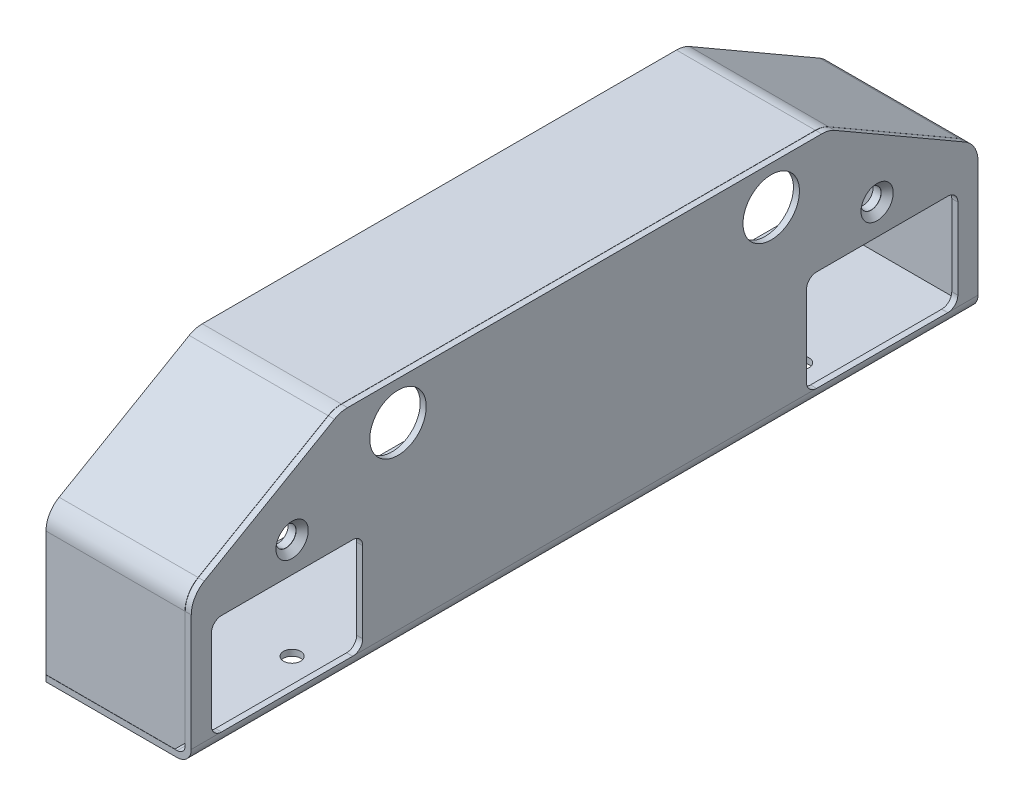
ISO-10303-21;
HEADER;
FILE_DESCRIPTION(('STEP AP214'),'2;1');
FILE_NAME('part.step','',(''),(''),'','','');
FILE_SCHEMA(('AUTOMOTIVE_DESIGN { 1 0 10303 214 1 1 1 1 }'));
ENDSEC;
DATA;
#1=APPLICATION_CONTEXT('core data for automotive mechanical design processes');
#2=APPLICATION_PROTOCOL_DEFINITION('international standard','automotive_design',2000,#1);
#3=PRODUCT_CONTEXT('',#1,'mechanical');
#4=PRODUCT('Part','Part','',(#3));
#5=PRODUCT_RELATED_PRODUCT_CATEGORY('part','',(#4));
#6=PRODUCT_DEFINITION_FORMATION('','',#4);
#7=PRODUCT_DEFINITION_CONTEXT('part definition',#1,'design');
#8=PRODUCT_DEFINITION('design','',#6,#7);
#9=PRODUCT_DEFINITION_SHAPE('','',#8);
#10=(LENGTH_UNIT() NAMED_UNIT(*) SI_UNIT(.MILLI.,.METRE.));
#11=(NAMED_UNIT(*) PLANE_ANGLE_UNIT() SI_UNIT($,.RADIAN.));
#12=(NAMED_UNIT(*) SI_UNIT($,.STERADIAN.) SOLID_ANGLE_UNIT());
#13=UNCERTAINTY_MEASURE_WITH_UNIT(LENGTH_MEASURE(1.E-05),#10,'distance_accuracy_value','');
#14=(GEOMETRIC_REPRESENTATION_CONTEXT(3) GLOBAL_UNCERTAINTY_ASSIGNED_CONTEXT((#13)) GLOBAL_UNIT_ASSIGNED_CONTEXT((#10,
#11,#12)) REPRESENTATION_CONTEXT('',''));
#15=CARTESIAN_POINT('',(0.,0.,0.));
#16=DIRECTION('',(0.,0.,1.));
#17=DIRECTION('',(1.,0.,0.));
#18=AXIS2_PLACEMENT_3D('',#15,#16,#17);
#19=CARTESIAN_POINT('',(-66.,-50.2872084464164,-181.9));
#20=DIRECTION('',(-1.,0.,0.));
#21=DIRECTION('',(0.,0.,1.));
#22=AXIS2_PLACEMENT_3D('',#19,#20,#21);
#23=CYLINDRICAL_SURFACE('',#22,10.);
#24=CARTESIAN_POINT('',(-69.,-50.2872084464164,-181.9));
#25=DIRECTION('',(-1.,0.,0.));
#26=DIRECTION('',(0.,0.,1.));
#27=AXIS2_PLACEMENT_3D('',#24,#25,#26);
#28=CIRCLE('',#27,10.);
#29=CARTESIAN_POINT('',(-69.,-41.626954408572,-186.9));
#30=VERTEX_POINT('',#29);
#31=CARTESIAN_POINT('',(-69.,-50.2872084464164,-191.9));
#32=VERTEX_POINT('',#31);
#33=EDGE_CURVE('E95',#30,#32,#28,.T.);
#34=ORIENTED_EDGE('',*,*,#33,.F.);
#35=DIRECTION('',(-1.,0.,0.));
#36=VECTOR('',#35,1.);
#37=CARTESIAN_POINT('',(-66.,-41.626954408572,-186.9));
#38=LINE('',#37,#36);
#39=CARTESIAN_POINT('',(-66.,-41.626954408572,-186.9));
#40=VERTEX_POINT('',#39);
#41=EDGE_CURVE('E12',#40,#30,#38,.T.);
#42=ORIENTED_EDGE('',*,*,#41,.F.);
#43=CARTESIAN_POINT('',(-66.,-50.2872084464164,-181.9));
#44=DIRECTION('',(-1.,0.,0.));
#45=DIRECTION('',(0.,0.,1.));
#46=AXIS2_PLACEMENT_3D('',#43,#44,#45);
#47=CIRCLE('',#46,10.);
#48=CARTESIAN_POINT('',(-66.,-50.2872084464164,-191.9));
#49=VERTEX_POINT('',#48);
#50=EDGE_CURVE('E97',#40,#49,#47,.T.);
#51=ORIENTED_EDGE('',*,*,#50,.T.);
#52=DIRECTION('',(-1.,0.,0.));
#53=VECTOR('',#52,1.);
#54=CARTESIAN_POINT('',(-66.,-50.2872084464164,-191.9));
#55=LINE('',#54,#53);
#56=EDGE_CURVE('E46',#49,#32,#55,.T.);
#57=ORIENTED_EDGE('',*,*,#56,.T.);
#58=EDGE_LOOP('',(#34,#42,#51,#57));
#59=FACE_BOUND('',#58,.T.);
#60=ADVANCED_FACE('F43',(#59),#23,.T.);
#61=CARTESIAN_POINT('',(-66.,-4.42634850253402,-122.466660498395));
#62=DIRECTION('',(0.,0.866025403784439,-0.5));
#63=DIRECTION('',(0.,0.5,0.866025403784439));
#64=AXIS2_PLACEMENT_3D('',#61,#62,#63);
#65=PLANE('',#64);
#66=DIRECTION('',(0.,-0.5,-0.866025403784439));
#67=VECTOR('',#66,1.);
#68=CARTESIAN_POINT('',(-69.,-4.42634850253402,-122.466660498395));
#69=LINE('',#68,#67);
#70=CARTESIAN_POINT('',(-69.,-4.42634850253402,-122.466660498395));
#71=VERTEX_POINT('',#70);
#72=EDGE_CURVE('E113',#71,#30,#69,.T.);
#73=ORIENTED_EDGE('',*,*,#72,.F.);
#74=DIRECTION('',(-1.,0.,0.));
#75=VECTOR('',#74,1.);
#76=CARTESIAN_POINT('',(-66.,-4.42634850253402,-122.466660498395));
#77=LINE('',#76,#75);
#78=CARTESIAN_POINT('',(-66.,-4.42634850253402,-122.466660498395));
#79=VERTEX_POINT('',#78);
#80=EDGE_CURVE('E51',#79,#71,#77,.T.);
#81=ORIENTED_EDGE('',*,*,#80,.F.);
#82=DIRECTION('',(0.,-0.5,-0.866025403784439));
#83=VECTOR('',#82,1.);
#84=CARTESIAN_POINT('',(-66.,-4.42634850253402,-122.466660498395));
#85=LINE('',#84,#83);
#86=EDGE_CURVE('E102',#79,#40,#85,.T.);
#87=ORIENTED_EDGE('',*,*,#86,.T.);
#88=ORIENTED_EDGE('',*,*,#41,.T.);
#89=EDGE_LOOP('',(#73,#81,#87,#88));
#90=FACE_BOUND('',#89,.T.);
#91=ADVANCED_FACE('F148',(#90),#65,.T.);
#92=CARTESIAN_POINT('',(-66.,-13.,-117.516660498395));
#93=DIRECTION('',(-1.,0.,0.));
#94=DIRECTION('',(0.,0.,1.));
#95=AXIS2_PLACEMENT_3D('',#92,#93,#94);
#96=CYLINDRICAL_SURFACE('',#95,9.9);
#97=CARTESIAN_POINT('',(-69.,-13.,-117.516660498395));
#98=DIRECTION('',(-1.,0.,0.));
#99=DIRECTION('',(0.,0.,-1.));
#100=AXIS2_PLACEMENT_3D('',#97,#98,#99);
#101=CIRCLE('',#100,9.9);
#102=CARTESIAN_POINT('',(-69.,-3.1,-117.516660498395));
#103=VERTEX_POINT('',#102);
#104=EDGE_CURVE('E120',#103,#71,#101,.T.);
#105=ORIENTED_EDGE('',*,*,#104,.F.);
#106=DIRECTION('',(-1.,0.,0.));
#107=VECTOR('',#106,1.);
#108=CARTESIAN_POINT('',(-66.,-3.1,-117.516660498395));
#109=LINE('',#108,#107);
#110=CARTESIAN_POINT('',(-66.,-3.1,-117.516660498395));
#111=VERTEX_POINT('',#110);
#112=EDGE_CURVE('E136',#111,#103,#109,.T.);
#113=ORIENTED_EDGE('',*,*,#112,.F.);
#114=CARTESIAN_POINT('',(-66.,-13.,-117.516660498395));
#115=DIRECTION('',(-1.,0.,0.));
#116=DIRECTION('',(0.,0.,-1.));
#117=AXIS2_PLACEMENT_3D('',#114,#115,#116);
#118=CIRCLE('',#117,9.9);
#119=EDGE_CURVE('E132',#111,#79,#118,.T.);
#120=ORIENTED_EDGE('',*,*,#119,.T.);
#121=ORIENTED_EDGE('',*,*,#80,.T.);
#122=EDGE_LOOP('',(#105,#113,#120,#121));
#123=FACE_BOUND('',#122,.T.);
#124=ADVANCED_FACE('F153',(#123),#96,.T.);
#125=CARTESIAN_POINT('',(-66.,-3.10000000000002,-102.369357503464));
#126=DIRECTION('',(0.,1.,0.));
#127=DIRECTION('',(0.,0.,1.));
#128=AXIS2_PLACEMENT_3D('',#125,#126,#127);
#129=PLANE('',#128);
#130=DIRECTION('',(0.,0.,-1.));
#131=VECTOR('',#130,1.);
#132=CARTESIAN_POINT('',(-69.,-3.10000000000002,-102.369357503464));
#133=LINE('',#132,#131);
#134=CARTESIAN_POINT('',(-69.,-3.10000000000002,-102.369357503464));
#135=VERTEX_POINT('',#134);
#136=EDGE_CURVE('E117',#135,#103,#133,.T.);
#137=ORIENTED_EDGE('',*,*,#136,.F.);
#138=DIRECTION('',(-1.,0.,0.));
#139=VECTOR('',#138,1.);
#140=CARTESIAN_POINT('',(-66.,-3.10000000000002,-102.369357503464));
#141=LINE('',#140,#139);
#142=CARTESIAN_POINT('',(-66.,-3.10000000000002,-102.369357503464));
#143=VERTEX_POINT('',#142);
#144=EDGE_CURVE('E138',#143,#135,#141,.T.);
#145=ORIENTED_EDGE('',*,*,#144,.F.);
#146=DIRECTION('',(0.,0.,-1.));
#147=VECTOR('',#146,1.);
#148=CARTESIAN_POINT('',(-66.,-3.10000000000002,-102.369357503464));
#149=LINE('',#148,#147);
#150=EDGE_CURVE('E129',#143,#111,#149,.T.);
#151=ORIENTED_EDGE('',*,*,#150,.T.);
#152=ORIENTED_EDGE('',*,*,#112,.T.);
#153=EDGE_LOOP('',(#137,#145,#151,#152));
#154=FACE_BOUND('',#153,.T.);
#155=ADVANCED_FACE('F145',(#154),#129,.T.);
#156=CARTESIAN_POINT('',(-66.,-3.10000000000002,-102.369357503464));
#157=DIRECTION('',(0.,-0.866025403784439,0.5));
#158=DIRECTION('',(0.,-0.5,-0.866025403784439));
#159=AXIS2_PLACEMENT_3D('',#156,#157,#158);
#160=PLANE('',#159);
#161=DIRECTION('',(0.,0.5,0.866025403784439));
#162=VECTOR('',#161,1.);
#163=CARTESIAN_POINT('',(-69.,-3.10000000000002,-102.369357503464));
#164=LINE('',#163,#162);
#165=CARTESIAN_POINT('',(-69.,-54.7905405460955,-191.9));
#166=VERTEX_POINT('',#165);
#167=EDGE_CURVE('E109',#166,#135,#164,.T.);
#168=ORIENTED_EDGE('',*,*,#167,.F.);
#169=DIRECTION('',(-1.,0.,0.));
#170=VECTOR('',#169,1.);
#171=CARTESIAN_POINT('',(-66.,-54.7905405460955,-191.9));
#172=LINE('',#171,#170);
#173=CARTESIAN_POINT('',(-66.,-54.7905405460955,-191.9));
#174=VERTEX_POINT('',#173);
#175=EDGE_CURVE('E101',#174,#166,#172,.T.);
#176=ORIENTED_EDGE('',*,*,#175,.F.);
#177=DIRECTION('',(0.,0.5,0.866025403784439));
#178=VECTOR('',#177,1.);
#179=CARTESIAN_POINT('',(-66.,-3.10000000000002,-102.369357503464));
#180=LINE('',#179,#178);
#181=EDGE_CURVE('E126',#174,#143,#180,.T.);
#182=ORIENTED_EDGE('',*,*,#181,.T.);
#183=ORIENTED_EDGE('',*,*,#144,.T.);
#184=EDGE_LOOP('',(#168,#176,#182,#183));
#185=FACE_BOUND('',#184,.T.);
#186=ADVANCED_FACE('F141',(#185),#160,.T.);
#187=CARTESIAN_POINT('',(-66.,-54.7905405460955,-191.9));
#188=DIRECTION('',(0.,0.,-1.));
#189=DIRECTION('',(0.,1.,0.));
#190=AXIS2_PLACEMENT_3D('',#187,#188,#189);
#191=PLANE('',#190);
#192=DIRECTION('',(0.,-1.,0.));
#193=VECTOR('',#192,1.);
#194=CARTESIAN_POINT('',(-69.,-54.7905405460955,-191.9));
#195=LINE('',#194,#193);
#196=EDGE_CURVE('E104',#32,#166,#195,.T.);
#197=ORIENTED_EDGE('',*,*,#196,.F.);
#198=ORIENTED_EDGE('',*,*,#56,.F.);
#199=DIRECTION('',(0.,-1.,0.));
#200=VECTOR('',#199,1.);
#201=CARTESIAN_POINT('',(-66.,-54.7905405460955,-191.9));
#202=LINE('',#201,#200);
#203=EDGE_CURVE('E124',#49,#174,#202,.T.);
#204=ORIENTED_EDGE('',*,*,#203,.T.);
#205=ORIENTED_EDGE('',*,*,#175,.T.);
#206=EDGE_LOOP('',(#197,#198,#204,#205));
#207=FACE_BOUND('',#206,.T.);
#208=ADVANCED_FACE('F105',(#207),#191,.T.);
#209=CARTESIAN_POINT('',(-66.,-50.2872084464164,-181.9));
#210=DIRECTION('',(-1.,0.,0.));
#211=DIRECTION('',(0.,0.,1.));
#212=AXIS2_PLACEMENT_3D('',#209,#210,#211);
#213=PLANE('',#212);
#214=ORIENTED_EDGE('',*,*,#50,.F.);
#215=ORIENTED_EDGE('',*,*,#86,.F.);
#216=ORIENTED_EDGE('',*,*,#119,.F.);
#217=ORIENTED_EDGE('',*,*,#150,.F.);
#218=ORIENTED_EDGE('',*,*,#181,.F.);
#219=ORIENTED_EDGE('',*,*,#203,.F.);
#220=EDGE_LOOP('',(#214,#215,#216,#217,#218,#219));
#221=FACE_BOUND('',#220,.T.);
#222=ADVANCED_FACE('F152',(#221),#213,.F.);
#223=CARTESIAN_POINT('',(-69.,-50.2872084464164,-181.9));
#224=DIRECTION('',(-1.,0.,0.));
#225=DIRECTION('',(0.,0.,1.));
#226=AXIS2_PLACEMENT_3D('',#223,#224,#225);
#227=PLANE('',#226);
#228=ORIENTED_EDGE('',*,*,#33,.T.);
#229=ORIENTED_EDGE('',*,*,#196,.T.);
#230=ORIENTED_EDGE('',*,*,#167,.T.);
#231=ORIENTED_EDGE('',*,*,#136,.T.);
#232=ORIENTED_EDGE('',*,*,#104,.T.);
#233=ORIENTED_EDGE('',*,*,#72,.T.);
#234=EDGE_LOOP('',(#228,#229,#230,#231,#232,#233));
#235=FACE_BOUND('',#234,.T.);
#236=ADVANCED_FACE('F111',(#235),#227,.T.);
#237=CLOSED_SHELL('',(#60,#91,#124,#155,#186,#208,#222,#236));
#238=MANIFOLD_SOLID_BREP('B2',#237);
#239=CARTESIAN_POINT('',(-66.,-3.10000000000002,102.369357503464));
#240=DIRECTION('',(0.,1.,0.));
#241=DIRECTION('',(0.,0.,1.));
#242=AXIS2_PLACEMENT_3D('',#239,#240,#241);
#243=PLANE('',#242);
#244=DIRECTION('',(0.,0.,-1.));
#245=VECTOR('',#244,1.);
#246=CARTESIAN_POINT('',(-69.,-3.10000000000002,102.369357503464));
#247=LINE('',#246,#245);
#248=CARTESIAN_POINT('',(-69.,-3.1,117.516660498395));
#249=VERTEX_POINT('',#248);
#250=CARTESIAN_POINT('',(-69.,-3.10000000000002,102.369357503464));
#251=VERTEX_POINT('',#250);
#252=EDGE_CURVE('E280',#249,#251,#247,.T.);
#253=ORIENTED_EDGE('',*,*,#252,.F.);
#254=DIRECTION('',(-1.,0.,0.));
#255=VECTOR('',#254,1.);
#256=CARTESIAN_POINT('',(-66.,-3.1,117.516660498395));
#257=LINE('',#256,#255);
#258=CARTESIAN_POINT('',(-66.,-3.1,117.516660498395));
#259=VERTEX_POINT('',#258);
#260=EDGE_CURVE('E41',#259,#249,#257,.T.);
#261=ORIENTED_EDGE('',*,*,#260,.F.);
#262=DIRECTION('',(0.,0.,-1.));
#263=VECTOR('',#262,1.);
#264=CARTESIAN_POINT('',(-66.,-3.10000000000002,102.369357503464));
#265=LINE('',#264,#263);
#266=CARTESIAN_POINT('',(-66.,-3.10000000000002,102.369357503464));
#267=VERTEX_POINT('',#266);
#268=EDGE_CURVE('E282',#259,#267,#265,.T.);
#269=ORIENTED_EDGE('',*,*,#268,.T.);
#270=DIRECTION('',(-1.,0.,0.));
#271=VECTOR('',#270,1.);
#272=CARTESIAN_POINT('',(-66.,-3.10000000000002,102.369357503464));
#273=LINE('',#272,#271);
#274=EDGE_CURVE('E231',#267,#251,#273,.T.);
#275=ORIENTED_EDGE('',*,*,#274,.T.);
#276=EDGE_LOOP('',(#253,#261,#269,#275));
#277=FACE_BOUND('',#276,.T.);
#278=ADVANCED_FACE('F228',(#277),#243,.T.);
#279=CARTESIAN_POINT('',(-66.,-13.,117.516660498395));
#280=DIRECTION('',(-1.,0.,0.));
#281=DIRECTION('',(0.,0.,1.));
#282=AXIS2_PLACEMENT_3D('',#279,#280,#281);
#283=CYLINDRICAL_SURFACE('',#282,9.9);
#284=CARTESIAN_POINT('',(-69.,-13.,117.516660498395));
#285=DIRECTION('',(-1.,0.,0.));
#286=DIRECTION('',(0.,0.,1.));
#287=AXIS2_PLACEMENT_3D('',#284,#285,#286);
#288=CIRCLE('',#287,9.9);
#289=CARTESIAN_POINT('',(-69.,-4.42634850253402,122.466660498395));
#290=VERTEX_POINT('',#289);
#291=EDGE_CURVE('E298',#290,#249,#288,.T.);
#292=ORIENTED_EDGE('',*,*,#291,.F.);
#293=DIRECTION('',(-1.,0.,0.));
#294=VECTOR('',#293,1.);
#295=CARTESIAN_POINT('',(-66.,-4.42634850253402,122.466660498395));
#296=LINE('',#295,#294);
#297=CARTESIAN_POINT('',(-66.,-4.42634850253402,122.466660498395));
#298=VERTEX_POINT('',#297);
#299=EDGE_CURVE('E236',#298,#290,#296,.T.);
#300=ORIENTED_EDGE('',*,*,#299,.F.);
#301=CARTESIAN_POINT('',(-66.,-13.,117.516660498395));
#302=DIRECTION('',(-1.,0.,0.));
#303=DIRECTION('',(0.,0.,1.));
#304=AXIS2_PLACEMENT_3D('',#301,#302,#303);
#305=CIRCLE('',#304,9.9);
#306=EDGE_CURVE('E287',#298,#259,#305,.T.);
#307=ORIENTED_EDGE('',*,*,#306,.T.);
#308=ORIENTED_EDGE('',*,*,#260,.T.);
#309=EDGE_LOOP('',(#292,#300,#307,#308));
#310=FACE_BOUND('',#309,.T.);
#311=ADVANCED_FACE('F333',(#310),#283,.T.);
#312=CARTESIAN_POINT('',(-66.,-4.42634850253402,122.466660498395));
#313=DIRECTION('',(0.,0.866025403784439,0.5));
#314=DIRECTION('',(0.,-0.5,0.866025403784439));
#315=AXIS2_PLACEMENT_3D('',#312,#313,#314);
#316=PLANE('',#315);
#317=DIRECTION('',(0.,0.5,-0.866025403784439));
#318=VECTOR('',#317,1.);
#319=CARTESIAN_POINT('',(-69.,-4.42634850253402,122.466660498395));
#320=LINE('',#319,#318);
#321=CARTESIAN_POINT('',(-69.,-41.626954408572,186.9));
#322=VERTEX_POINT('',#321);
#323=EDGE_CURVE('E305',#322,#290,#320,.T.);
#324=ORIENTED_EDGE('',*,*,#323,.F.);
#325=DIRECTION('',(-1.,0.,0.));
#326=VECTOR('',#325,1.);
#327=CARTESIAN_POINT('',(-66.,-41.626954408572,186.9));
#328=LINE('',#327,#326);
#329=CARTESIAN_POINT('',(-66.,-41.626954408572,186.9));
#330=VERTEX_POINT('',#329);
#331=EDGE_CURVE('E321',#330,#322,#328,.T.);
#332=ORIENTED_EDGE('',*,*,#331,.F.);
#333=DIRECTION('',(0.,0.5,-0.866025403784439));
#334=VECTOR('',#333,1.);
#335=CARTESIAN_POINT('',(-66.,-4.42634850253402,122.466660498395));
#336=LINE('',#335,#334);
#337=EDGE_CURVE('E317',#330,#298,#336,.T.);
#338=ORIENTED_EDGE('',*,*,#337,.T.);
#339=ORIENTED_EDGE('',*,*,#299,.T.);
#340=EDGE_LOOP('',(#324,#332,#338,#339));
#341=FACE_BOUND('',#340,.T.);
#342=ADVANCED_FACE('F338',(#341),#316,.T.);
#343=CARTESIAN_POINT('',(-66.,-50.2872084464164,181.9));
#344=DIRECTION('',(-1.,0.,0.));
#345=DIRECTION('',(0.,0.,1.));
#346=AXIS2_PLACEMENT_3D('',#343,#344,#345);
#347=CYLINDRICAL_SURFACE('',#346,10.);
#348=CARTESIAN_POINT('',(-69.,-50.2872084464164,181.9));
#349=DIRECTION('',(-1.,0.,0.));
#350=DIRECTION('',(0.,0.,-1.));
#351=AXIS2_PLACEMENT_3D('',#348,#349,#350);
#352=CIRCLE('',#351,10.);
#353=CARTESIAN_POINT('',(-69.,-50.2872084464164,191.9));
#354=VERTEX_POINT('',#353);
#355=EDGE_CURVE('E302',#354,#322,#352,.T.);
#356=ORIENTED_EDGE('',*,*,#355,.F.);
#357=DIRECTION('',(-1.,0.,0.));
#358=VECTOR('',#357,1.);
#359=CARTESIAN_POINT('',(-66.,-50.2872084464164,191.9));
#360=LINE('',#359,#358);
#361=CARTESIAN_POINT('',(-66.,-50.2872084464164,191.9));
#362=VERTEX_POINT('',#361);
#363=EDGE_CURVE('E323',#362,#354,#360,.T.);
#364=ORIENTED_EDGE('',*,*,#363,.F.);
#365=CARTESIAN_POINT('',(-66.,-50.2872084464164,181.9));
#366=DIRECTION('',(-1.,0.,0.));
#367=DIRECTION('',(0.,0.,-1.));
#368=AXIS2_PLACEMENT_3D('',#365,#366,#367);
#369=CIRCLE('',#368,10.);
#370=EDGE_CURVE('E314',#362,#330,#369,.T.);
#371=ORIENTED_EDGE('',*,*,#370,.T.);
#372=ORIENTED_EDGE('',*,*,#331,.T.);
#373=EDGE_LOOP('',(#356,#364,#371,#372));
#374=FACE_BOUND('',#373,.T.);
#375=ADVANCED_FACE('F330',(#374),#347,.T.);
#376=CARTESIAN_POINT('',(-66.,-54.7905405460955,191.9));
#377=DIRECTION('',(0.,0.,1.));
#378=DIRECTION('',(0.,-1.,0.));
#379=AXIS2_PLACEMENT_3D('',#376,#377,#378);
#380=PLANE('',#379);
#381=DIRECTION('',(0.,1.,0.));
#382=VECTOR('',#381,1.);
#383=CARTESIAN_POINT('',(-69.,-54.7905405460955,191.9));
#384=LINE('',#383,#382);
#385=CARTESIAN_POINT('',(-69.,-54.7905405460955,191.9));
#386=VERTEX_POINT('',#385);
#387=EDGE_CURVE('E294',#386,#354,#384,.T.);
#388=ORIENTED_EDGE('',*,*,#387,.F.);
#389=DIRECTION('',(-1.,0.,0.));
#390=VECTOR('',#389,1.);
#391=CARTESIAN_POINT('',(-66.,-54.7905405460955,191.9));
#392=LINE('',#391,#390);
#393=CARTESIAN_POINT('',(-66.,-54.7905405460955,191.9));
#394=VERTEX_POINT('',#393);
#395=EDGE_CURVE('E286',#394,#386,#392,.T.);
#396=ORIENTED_EDGE('',*,*,#395,.F.);
#397=DIRECTION('',(0.,1.,0.));
#398=VECTOR('',#397,1.);
#399=CARTESIAN_POINT('',(-66.,-54.7905405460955,191.9));
#400=LINE('',#399,#398);
#401=EDGE_CURVE('E311',#394,#362,#400,.T.);
#402=ORIENTED_EDGE('',*,*,#401,.T.);
#403=ORIENTED_EDGE('',*,*,#363,.T.);
#404=EDGE_LOOP('',(#388,#396,#402,#403));
#405=FACE_BOUND('',#404,.T.);
#406=ADVANCED_FACE('F326',(#405),#380,.T.);
#407=CARTESIAN_POINT('',(-66.,-3.10000000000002,102.369357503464));
#408=DIRECTION('',(0.,-0.866025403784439,-0.5));
#409=DIRECTION('',(0.,0.5,-0.866025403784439));
#410=AXIS2_PLACEMENT_3D('',#407,#408,#409);
#411=PLANE('',#410);
#412=DIRECTION('',(0.,-0.5,0.866025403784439));
#413=VECTOR('',#412,1.);
#414=CARTESIAN_POINT('',(-69.,-3.10000000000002,102.369357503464));
#415=LINE('',#414,#413);
#416=EDGE_CURVE('E289',#251,#386,#415,.T.);
#417=ORIENTED_EDGE('',*,*,#416,.F.);
#418=ORIENTED_EDGE('',*,*,#274,.F.);
#419=DIRECTION('',(0.,-0.5,0.866025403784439));
#420=VECTOR('',#419,1.);
#421=CARTESIAN_POINT('',(-66.,-3.10000000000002,102.369357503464));
#422=LINE('',#421,#420);
#423=EDGE_CURVE('E309',#267,#394,#422,.T.);
#424=ORIENTED_EDGE('',*,*,#423,.T.);
#425=ORIENTED_EDGE('',*,*,#395,.T.);
#426=EDGE_LOOP('',(#417,#418,#424,#425));
#427=FACE_BOUND('',#426,.T.);
#428=ADVANCED_FACE('F290',(#427),#411,.T.);
#429=CARTESIAN_POINT('',(-66.,-13.,117.516660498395));
#430=DIRECTION('',(-1.,0.,0.));
#431=DIRECTION('',(0.,0.,1.));
#432=AXIS2_PLACEMENT_3D('',#429,#430,#431);
#433=PLANE('',#432);
#434=ORIENTED_EDGE('',*,*,#268,.F.);
#435=ORIENTED_EDGE('',*,*,#306,.F.);
#436=ORIENTED_EDGE('',*,*,#337,.F.);
#437=ORIENTED_EDGE('',*,*,#370,.F.);
#438=ORIENTED_EDGE('',*,*,#401,.F.);
#439=ORIENTED_EDGE('',*,*,#423,.F.);
#440=EDGE_LOOP('',(#434,#435,#436,#437,#438,#439));
#441=FACE_BOUND('',#440,.T.);
#442=ADVANCED_FACE('F337',(#441),#433,.F.);
#443=CARTESIAN_POINT('',(-69.,-13.,117.516660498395));
#444=DIRECTION('',(-1.,0.,0.));
#445=DIRECTION('',(0.,0.,1.));
#446=AXIS2_PLACEMENT_3D('',#443,#444,#445);
#447=PLANE('',#446);
#448=ORIENTED_EDGE('',*,*,#252,.T.);
#449=ORIENTED_EDGE('',*,*,#416,.T.);
#450=ORIENTED_EDGE('',*,*,#387,.T.);
#451=ORIENTED_EDGE('',*,*,#355,.T.);
#452=ORIENTED_EDGE('',*,*,#323,.T.);
#453=ORIENTED_EDGE('',*,*,#291,.T.);
#454=EDGE_LOOP('',(#448,#449,#450,#451,#452,#453));
#455=FACE_BOUND('',#454,.T.);
#456=ADVANCED_FACE('F296',(#455),#447,.T.);
#457=CLOSED_SHELL('',(#278,#311,#342,#375,#406,#428,#442,#456));
#458=MANIFOLD_SOLID_BREP('B6',#457);
#459=CARTESIAN_POINT('',(-3.99999999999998,-50.5,-152.5));
#460=DIRECTION('',(-1.,0.,0.));
#461=DIRECTION('',(0.,-1.,0.));
#462=AXIS2_PLACEMENT_3D('',#459,#460,#461);
#463=PLANE('',#462);
#464=CARTESIAN_POINT('',(-3.99999999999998,-43.,-145.));
#465=DIRECTION('',(-1.,0.,0.));
#466=DIRECTION('',(0.,-1.,0.));
#467=AXIS2_PLACEMENT_3D('',#464,#465,#466);
#468=CIRCLE('',#467,4.99999999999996);
#469=CARTESIAN_POINT('',(-3.99999999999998,-47.9999999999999,-145.));
#470=VERTEX_POINT('',#469);
#471=EDGE_CURVE('E472',#470,#470,#468,.T.);
#472=ORIENTED_EDGE('',*,*,#471,.F.);
#473=EDGE_LOOP('',(#472));
#474=FACE_BOUND('',#473,.T.);
#475=DIRECTION('',(0.,-1.,0.));
#476=VECTOR('',#475,1.);
#477=CARTESIAN_POINT('',(-3.99999999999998,-35.5,-152.5));
#478=LINE('',#477,#476);
#479=CARTESIAN_POINT('',(-3.99999999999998,-35.5,-152.5));
#480=VERTEX_POINT('',#479);
#481=CARTESIAN_POINT('',(-3.99999999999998,-50.5,-152.5));
#482=VERTEX_POINT('',#481);
#483=EDGE_CURVE('E482',#480,#482,#478,.T.);
#484=ORIENTED_EDGE('',*,*,#483,.T.);
#485=DIRECTION('',(0.,0.,1.));
#486=VECTOR('',#485,1.);
#487=CARTESIAN_POINT('',(-3.99999999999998,-50.5,-152.5));
#488=LINE('',#487,#486);
#489=CARTESIAN_POINT('',(-4.,-50.5,152.5));
#490=VERTEX_POINT('',#489);
#491=EDGE_CURVE('E467',#482,#490,#488,.T.);
#492=ORIENTED_EDGE('',*,*,#491,.T.);
#493=DIRECTION('',(0.,1.,0.));
#494=VECTOR('',#493,1.);
#495=CARTESIAN_POINT('',(-4.00000000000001,-35.5,152.5));
#496=LINE('',#495,#494);
#497=CARTESIAN_POINT('',(-4.00000000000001,-35.5,152.5));
#498=VERTEX_POINT('',#497);
#499=EDGE_CURVE('E433',#490,#498,#496,.T.);
#500=ORIENTED_EDGE('',*,*,#499,.T.);
#501=DIRECTION('',(0.,0.,-1.));
#502=VECTOR('',#501,1.);
#503=CARTESIAN_POINT('',(-3.99999999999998,-35.5,-152.5));
#504=LINE('',#503,#502);
#505=EDGE_CURVE('E428',#498,#480,#504,.T.);
#506=ORIENTED_EDGE('',*,*,#505,.T.);
#507=EDGE_LOOP('',(#484,#492,#500,#506));
#508=FACE_BOUND('',#507,.T.);
#509=CARTESIAN_POINT('',(-4.00000000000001,-43.,145.));
#510=DIRECTION('',(-1.,0.,0.));
#511=DIRECTION('',(0.,-1.,0.));
#512=AXIS2_PLACEMENT_3D('',#509,#510,#511);
#513=CIRCLE('',#512,4.99999999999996);
#514=CARTESIAN_POINT('',(-4.,-48.,145.));
#515=VERTEX_POINT('',#514);
#516=EDGE_CURVE('E500',#515,#515,#513,.T.);
#517=ORIENTED_EDGE('',*,*,#516,.F.);
#518=EDGE_LOOP('',(#517));
#519=FACE_BOUND('',#518,.T.);
#520=ADVANCED_FACE('F413',(#474,#508,#519),#463,.T.);
#521=CARTESIAN_POINT('',(-0.099999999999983,-50.5,-152.5));
#522=DIRECTION('',(-1.,0.,0.));
#523=DIRECTION('',(0.,-1.,0.));
#524=AXIS2_PLACEMENT_3D('',#521,#522,#523);
#525=PLANE('',#524);
#526=CARTESIAN_POINT('',(-0.0999999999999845,-43.,-145.));
#527=DIRECTION('',(-1.,0.,0.));
#528=DIRECTION('',(0.,-1.,0.));
#529=AXIS2_PLACEMENT_3D('',#526,#527,#528);
#530=CIRCLE('',#529,4.99999999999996);
#531=CARTESIAN_POINT('',(-0.0999999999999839,-47.9999999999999,-145.));
#532=VERTEX_POINT('',#531);
#533=EDGE_CURVE('E475',#532,#532,#530,.T.);
#534=ORIENTED_EDGE('',*,*,#533,.T.);
#535=EDGE_LOOP('',(#534));
#536=FACE_BOUND('',#535,.T.);
#537=DIRECTION('',(0.,-1.,0.));
#538=VECTOR('',#537,1.);
#539=CARTESIAN_POINT('',(-0.0999999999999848,-35.5,-152.5));
#540=LINE('',#539,#538);
#541=CARTESIAN_POINT('',(-0.0999999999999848,-35.5,-152.5));
#542=VERTEX_POINT('',#541);
#543=CARTESIAN_POINT('',(-0.099999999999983,-50.5,-152.5));
#544=VERTEX_POINT('',#543);
#545=EDGE_CURVE('E459',#542,#544,#540,.T.);
#546=ORIENTED_EDGE('',*,*,#545,.F.);
#547=DIRECTION('',(0.,0.,-1.));
#548=VECTOR('',#547,1.);
#549=CARTESIAN_POINT('',(-0.0999999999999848,-35.5,-152.5));
#550=LINE('',#549,#548);
#551=CARTESIAN_POINT('',(-0.100000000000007,-35.5,152.5));
#552=VERTEX_POINT('',#551);
#553=EDGE_CURVE('E480',#552,#542,#550,.T.);
#554=ORIENTED_EDGE('',*,*,#553,.F.);
#555=DIRECTION('',(0.,1.,0.));
#556=VECTOR('',#555,1.);
#557=CARTESIAN_POINT('',(-0.100000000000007,-35.5,152.5));
#558=LINE('',#557,#556);
#559=CARTESIAN_POINT('',(-0.100000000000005,-50.5,152.5));
#560=VERTEX_POINT('',#559);
#561=EDGE_CURVE('E460',#560,#552,#558,.T.);
#562=ORIENTED_EDGE('',*,*,#561,.F.);
#563=DIRECTION('',(0.,0.,1.));
#564=VECTOR('',#563,1.);
#565=CARTESIAN_POINT('',(-0.099999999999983,-50.5,-152.5));
#566=LINE('',#565,#564);
#567=EDGE_CURVE('E454',#544,#560,#566,.T.);
#568=ORIENTED_EDGE('',*,*,#567,.F.);
#569=EDGE_LOOP('',(#546,#554,#562,#568));
#570=FACE_BOUND('',#569,.T.);
#571=CARTESIAN_POINT('',(-0.100000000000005,-43.,145.));
#572=DIRECTION('',(-1.,0.,0.));
#573=DIRECTION('',(0.,-1.,0.));
#574=AXIS2_PLACEMENT_3D('',#571,#572,#573);
#575=CIRCLE('',#574,4.99999999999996);
#576=CARTESIAN_POINT('',(-0.100000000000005,-48.,145.));
#577=VERTEX_POINT('',#576);
#578=EDGE_CURVE('E502',#577,#577,#575,.T.);
#579=ORIENTED_EDGE('',*,*,#578,.T.);
#580=EDGE_LOOP('',(#579));
#581=FACE_BOUND('',#580,.T.);
#582=ADVANCED_FACE('F455',(#536,#570,#581),#525,.F.);
#583=CARTESIAN_POINT('',(-3.99999999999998,-35.5,-152.5));
#584=DIRECTION('',(0.,0.,1.));
#585=DIRECTION('',(1.,0.,0.));
#586=AXIS2_PLACEMENT_3D('',#583,#584,#585);
#587=PLANE('',#586);
#588=ORIENTED_EDGE('',*,*,#545,.T.);
#589=DIRECTION('',(1.,0.,0.));
#590=VECTOR('',#589,1.);
#591=CARTESIAN_POINT('',(-3.99999999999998,-50.5,-152.5));
#592=LINE('',#591,#590);
#593=EDGE_CURVE('E226',#482,#544,#592,.T.);
#594=ORIENTED_EDGE('',*,*,#593,.F.);
#595=ORIENTED_EDGE('',*,*,#483,.F.);
#596=DIRECTION('',(1.,0.,0.));
#597=VECTOR('',#596,1.);
#598=CARTESIAN_POINT('',(-3.99999999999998,-35.5,-152.5));
#599=LINE('',#598,#597);
#600=EDGE_CURVE('E471',#480,#542,#599,.T.);
#601=ORIENTED_EDGE('',*,*,#600,.T.);
#602=EDGE_LOOP('',(#588,#594,#595,#601));
#603=FACE_BOUND('',#602,.T.);
#604=ADVANCED_FACE('F415',(#603),#587,.F.);
#605=CARTESIAN_POINT('',(-3.99999999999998,-50.5,-152.5));
#606=DIRECTION('',(0.,1.,0.));
#607=DIRECTION('',(-1.,0.,0.));
#608=AXIS2_PLACEMENT_3D('',#605,#606,#607);
#609=PLANE('',#608);
#610=ORIENTED_EDGE('',*,*,#567,.T.);
#611=DIRECTION('',(1.,0.,0.));
#612=VECTOR('',#611,1.);
#613=CARTESIAN_POINT('',(-4.,-50.5,152.5));
#614=LINE('',#613,#612);
#615=EDGE_CURVE('E421',#490,#560,#614,.T.);
#616=ORIENTED_EDGE('',*,*,#615,.F.);
#617=ORIENTED_EDGE('',*,*,#491,.F.);
#618=ORIENTED_EDGE('',*,*,#593,.T.);
#619=EDGE_LOOP('',(#610,#616,#617,#618));
#620=FACE_BOUND('',#619,.T.);
#621=ADVANCED_FACE('F466',(#620),#609,.F.);
#622=CARTESIAN_POINT('',(-4.00000000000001,-35.5,152.5));
#623=DIRECTION('',(0.,0.,-1.));
#624=DIRECTION('',(-1.,0.,0.));
#625=AXIS2_PLACEMENT_3D('',#622,#623,#624);
#626=PLANE('',#625);
#627=ORIENTED_EDGE('',*,*,#561,.T.);
#628=DIRECTION('',(1.,0.,0.));
#629=VECTOR('',#628,1.);
#630=CARTESIAN_POINT('',(-4.00000000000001,-35.5,152.5));
#631=LINE('',#630,#629);
#632=EDGE_CURVE('E488',#498,#552,#631,.T.);
#633=ORIENTED_EDGE('',*,*,#632,.F.);
#634=ORIENTED_EDGE('',*,*,#499,.F.);
#635=ORIENTED_EDGE('',*,*,#615,.T.);
#636=EDGE_LOOP('',(#627,#633,#634,#635));
#637=FACE_BOUND('',#636,.T.);
#638=ADVANCED_FACE('F491',(#637),#626,.F.);
#639=CARTESIAN_POINT('',(-3.99999999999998,-35.5,-152.5));
#640=DIRECTION('',(0.,-1.,0.));
#641=DIRECTION('',(1.,0.,0.));
#642=AXIS2_PLACEMENT_3D('',#639,#640,#641);
#643=PLANE('',#642);
#644=ORIENTED_EDGE('',*,*,#553,.T.);
#645=ORIENTED_EDGE('',*,*,#600,.F.);
#646=ORIENTED_EDGE('',*,*,#505,.F.);
#647=ORIENTED_EDGE('',*,*,#632,.T.);
#648=EDGE_LOOP('',(#644,#645,#646,#647));
#649=FACE_BOUND('',#648,.T.);
#650=ADVANCED_FACE('F493',(#649),#643,.F.);
#651=CARTESIAN_POINT('',(-3.99999999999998,-43.,-145.));
#652=DIRECTION('',(1.,0.,0.));
#653=DIRECTION('',(0.,1.,0.));
#654=AXIS2_PLACEMENT_3D('',#651,#652,#653);
#655=CYLINDRICAL_SURFACE('',#654,4.99999999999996);
#656=ORIENTED_EDGE('',*,*,#471,.T.);
#657=EDGE_LOOP('',(#656));
#658=FACE_BOUND('',#657,.T.);
#659=ORIENTED_EDGE('',*,*,#533,.F.);
#660=EDGE_LOOP('',(#659));
#661=FACE_BOUND('',#660,.T.);
#662=ADVANCED_FACE('F511',(#658,#661),#655,.F.);
#663=CARTESIAN_POINT('',(-4.00000000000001,-43.,145.));
#664=DIRECTION('',(1.,0.,0.));
#665=DIRECTION('',(0.,1.,0.));
#666=AXIS2_PLACEMENT_3D('',#663,#664,#665);
#667=CYLINDRICAL_SURFACE('',#666,4.99999999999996);
#668=ORIENTED_EDGE('',*,*,#516,.T.);
#669=EDGE_LOOP('',(#668));
#670=FACE_BOUND('',#669,.T.);
#671=ORIENTED_EDGE('',*,*,#578,.F.);
#672=EDGE_LOOP('',(#671));
#673=FACE_BOUND('',#672,.T.);
#674=ADVANCED_FACE('F509',(#670,#673),#667,.F.);
#675=CLOSED_SHELL('',(#520,#582,#604,#621,#638,#650,#662,#674));
#676=MANIFOLD_SOLID_BREP('B35',#675);
#677=CARTESIAN_POINT('',(-0.0999999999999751,-111.9,192.));
#678=DIRECTION('',(0.,-1.,0.));
#679=DIRECTION('',(0.,0.,-1.));
#680=AXIS2_PLACEMENT_3D('',#677,#678,#679);
#681=PLANE('',#680);
#682=DIRECTION('',(-1.,0.,0.));
#683=VECTOR('',#682,1.);
#684=CARTESIAN_POINT('',(-0.0999999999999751,-111.9,192.));
#685=LINE('',#684,#683);
#686=CARTESIAN_POINT('',(-5.09999999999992,-111.9,192.));
#687=VERTEX_POINT('',#686);
#688=CARTESIAN_POINT('',(-69.,-111.9,192.));
#689=VERTEX_POINT('',#688);
#690=EDGE_CURVE('E858',#687,#689,#685,.T.);
#691=ORIENTED_EDGE('',*,*,#690,.F.);
#692=DIRECTION('',(0.,0.,1.));
#693=VECTOR('',#692,1.);
#694=CARTESIAN_POINT('',(-5.09999999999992,-111.9,195.));
#695=LINE('',#694,#693);
#696=CARTESIAN_POINT('',(-5.09999999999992,-111.9,195.));
#697=VERTEX_POINT('',#696);
#698=EDGE_CURVE('E739',#687,#697,#695,.T.);
#699=ORIENTED_EDGE('',*,*,#698,.T.);
#700=DIRECTION('',(-1.,0.,0.));
#701=VECTOR('',#700,1.);
#702=CARTESIAN_POINT('',(-0.0999999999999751,-111.9,195.));
#703=LINE('',#702,#701);
#704=CARTESIAN_POINT('',(-69.,-111.9,195.));
#705=VERTEX_POINT('',#704);
#706=EDGE_CURVE('E734',#697,#705,#703,.T.);
#707=ORIENTED_EDGE('',*,*,#706,.T.);
#708=DIRECTION('',(0.,0.,1.));
#709=VECTOR('',#708,1.);
#710=CARTESIAN_POINT('',(-69.,-111.9,192.));
#711=LINE('',#710,#709);
#712=EDGE_CURVE('E737',#689,#705,#711,.T.);
#713=ORIENTED_EDGE('',*,*,#712,.F.);
#714=EDGE_LOOP('',(#691,#699,#707,#713));
#715=FACE_BOUND('',#714,.T.);
#716=ADVANCED_FACE('F587',(#715),#681,.T.);
#717=CARTESIAN_POINT('',(-0.0999999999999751,-111.9,192.));
#718=DIRECTION('',(0.,0.,-1.));
#719=DIRECTION('',(-1.,0.,0.));
#720=AXIS2_PLACEMENT_3D('',#717,#718,#719);
#721=PLANE('',#720);
#722=DIRECTION('',(0.,-1.,0.));
#723=VECTOR('',#722,1.);
#724=CARTESIAN_POINT('',(-0.0999999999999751,-111.9,192.));
#725=LINE('',#724,#723);
#726=CARTESIAN_POINT('',(-0.0999999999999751,-50.2294734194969,192.));
#727=VERTEX_POINT('',#726);
#728=CARTESIAN_POINT('',(-0.0999999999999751,-106.9,192.));
#729=VERTEX_POINT('',#728);
#730=EDGE_CURVE('E742',#727,#729,#725,.T.);
#731=ORIENTED_EDGE('',*,*,#730,.T.);
#732=DIRECTION('',(-0.707106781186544,-0.707106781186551,0.));
#733=VECTOR('',#732,1.);
#734=CARTESIAN_POINT('',(-2.59999999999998,-109.4,192.));
#735=LINE('',#734,#733);
#736=EDGE_CURVE('E411',#729,#687,#735,.T.);
#737=ORIENTED_EDGE('',*,*,#736,.T.);
#738=ORIENTED_EDGE('',*,*,#690,.T.);
#739=DIRECTION('',(0.,-1.,0.));
#740=VECTOR('',#739,1.);
#741=CARTESIAN_POINT('',(-69.,-111.9,192.));
#742=LINE('',#741,#740);
#743=CARTESIAN_POINT('',(-69.,-50.2294734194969,192.));
#744=VERTEX_POINT('',#743);
#745=EDGE_CURVE('E756',#744,#689,#742,.T.);
#746=ORIENTED_EDGE('',*,*,#745,.F.);
#747=DIRECTION('',(-1.,0.,0.));
#748=VECTOR('',#747,1.);
#749=CARTESIAN_POINT('',(-0.0999999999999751,-50.2294734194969,192.));
#750=LINE('',#749,#748);
#751=EDGE_CURVE('E861',#727,#744,#750,.T.);
#752=ORIENTED_EDGE('',*,*,#751,.F.);
#753=EDGE_LOOP('',(#731,#737,#738,#746,#752));
#754=FACE_BOUND('',#753,.T.);
#755=ADVANCED_FACE('F923',(#754),#721,.T.);
#756=CARTESIAN_POINT('',(-0.0999999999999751,-50.2294734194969,182.));
#757=DIRECTION('',(-1.,0.,0.));
#758=DIRECTION('',(0.,0.,1.));
#759=AXIS2_PLACEMENT_3D('',#756,#757,#758);
#760=CYLINDRICAL_SURFACE('',#759,10.);
#761=CARTESIAN_POINT('',(-69.,-50.2294734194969,182.));
#762=DIRECTION('',(1.,0.,0.));
#763=DIRECTION('',(0.,0.,1.));
#764=AXIS2_PLACEMENT_3D('',#761,#762,#763);
#765=CIRCLE('',#764,10.);
#766=CARTESIAN_POINT('',(-69.,-41.5692193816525,187.));
#767=VERTEX_POINT('',#766);
#768=EDGE_CURVE('E805',#767,#744,#765,.T.);
#769=ORIENTED_EDGE('',*,*,#768,.F.);
#770=DIRECTION('',(-1.,0.,0.));
#771=VECTOR('',#770,1.);
#772=CARTESIAN_POINT('',(-0.0999999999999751,-41.5692193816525,187.));
#773=LINE('',#772,#771);
#774=CARTESIAN_POINT('',(-0.0999999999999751,-41.5692193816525,187.));
#775=VERTEX_POINT('',#774);
#776=EDGE_CURVE('E863',#775,#767,#773,.T.);
#777=ORIENTED_EDGE('',*,*,#776,.F.);
#778=CARTESIAN_POINT('',(-0.0999999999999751,-50.2294734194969,182.));
#779=DIRECTION('',(1.,0.,0.));
#780=DIRECTION('',(0.,0.,1.));
#781=AXIS2_PLACEMENT_3D('',#778,#779,#780);
#782=CIRCLE('',#781,10.);
#783=EDGE_CURVE('E854',#775,#727,#782,.T.);
#784=ORIENTED_EDGE('',*,*,#783,.T.);
#785=ORIENTED_EDGE('',*,*,#751,.T.);
#786=EDGE_LOOP('',(#769,#777,#784,#785));
#787=FACE_BOUND('',#786,.T.);
#788=ADVANCED_FACE('F927',(#787),#760,.F.);
#789=CARTESIAN_POINT('',(-0.0999999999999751,-41.5692193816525,187.));
#790=DIRECTION('',(0.,-0.866025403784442,-0.499999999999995));
#791=DIRECTION('',(0.,0.499999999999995,-0.866025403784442));
#792=AXIS2_PLACEMENT_3D('',#789,#790,#791);
#793=PLANE('',#792);
#794=DIRECTION('',(0.,-0.499999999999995,0.866025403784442));
#795=VECTOR('',#794,1.);
#796=CARTESIAN_POINT('',(-69.,-41.5692193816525,187.));
#797=LINE('',#796,#795);
#798=CARTESIAN_POINT('',(-69.,-4.33974596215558,122.516660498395));
#799=VERTEX_POINT('',#798);
#800=EDGE_CURVE('E802',#799,#767,#797,.T.);
#801=ORIENTED_EDGE('',*,*,#800,.F.);
#802=DIRECTION('',(-1.,0.,0.));
#803=VECTOR('',#802,1.);
#804=CARTESIAN_POINT('',(-0.0999999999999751,-4.33974596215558,122.516660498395));
#805=LINE('',#804,#803);
#806=CARTESIAN_POINT('',(-0.0999999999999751,-4.33974596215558,122.516660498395));
#807=VERTEX_POINT('',#806);
#808=EDGE_CURVE('E865',#807,#799,#805,.T.);
#809=ORIENTED_EDGE('',*,*,#808,.F.);
#810=DIRECTION('',(0.,-0.499999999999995,0.866025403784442));
#811=VECTOR('',#810,1.);
#812=CARTESIAN_POINT('',(-0.0999999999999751,-41.5692193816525,187.));
#813=LINE('',#812,#811);
#814=EDGE_CURVE('E851',#807,#775,#813,.T.);
#815=ORIENTED_EDGE('',*,*,#814,.T.);
#816=ORIENTED_EDGE('',*,*,#776,.T.);
#817=EDGE_LOOP('',(#801,#809,#815,#816));
#818=FACE_BOUND('',#817,.T.);
#819=ADVANCED_FACE('F932',(#818),#793,.T.);
#820=CARTESIAN_POINT('',(-0.0999999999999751,-13.,117.516660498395));
#821=DIRECTION('',(-1.,0.,0.));
#822=DIRECTION('',(0.,0.,1.));
#823=AXIS2_PLACEMENT_3D('',#820,#821,#822);
#824=CYLINDRICAL_SURFACE('',#823,9.99999999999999);
#825=CARTESIAN_POINT('',(-69.,-13.,117.516660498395));
#826=DIRECTION('',(1.,0.,0.));
#827=DIRECTION('',(0.,0.,1.));
#828=AXIS2_PLACEMENT_3D('',#825,#826,#827);
#829=CIRCLE('',#828,9.99999999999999);
#830=CARTESIAN_POINT('',(-69.,-3.,117.516660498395));
#831=VERTEX_POINT('',#830);
#832=EDGE_CURVE('E799',#831,#799,#829,.T.);
#833=ORIENTED_EDGE('',*,*,#832,.F.);
#834=DIRECTION('',(-1.,0.,0.));
#835=VECTOR('',#834,1.);
#836=CARTESIAN_POINT('',(-0.0999999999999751,-3.,117.516660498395));
#837=LINE('',#836,#835);
#838=CARTESIAN_POINT('',(-0.0999999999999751,-3.,117.516660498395));
#839=VERTEX_POINT('',#838);
#840=EDGE_CURVE('E867',#839,#831,#837,.T.);
#841=ORIENTED_EDGE('',*,*,#840,.F.);
#842=CARTESIAN_POINT('',(-0.0999999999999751,-13.,117.516660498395));
#843=DIRECTION('',(1.,0.,0.));
#844=DIRECTION('',(0.,0.,1.));
#845=AXIS2_PLACEMENT_3D('',#842,#843,#844);
#846=CIRCLE('',#845,9.99999999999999);
#847=EDGE_CURVE('E848',#839,#807,#846,.T.);
#848=ORIENTED_EDGE('',*,*,#847,.T.);
#849=ORIENTED_EDGE('',*,*,#808,.T.);
#850=EDGE_LOOP('',(#833,#841,#848,#849));
#851=FACE_BOUND('',#850,.T.);
#852=ADVANCED_FACE('F940',(#851),#824,.F.);
#853=CARTESIAN_POINT('',(-0.0999999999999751,-3.,117.516660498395));
#854=DIRECTION('',(0.,-1.,0.));
#855=DIRECTION('',(0.,0.,-1.));
#856=AXIS2_PLACEMENT_3D('',#853,#854,#855);
#857=PLANE('',#856);
#858=DIRECTION('',(0.,0.,1.));
#859=VECTOR('',#858,1.);
#860=CARTESIAN_POINT('',(-69.,-3.,117.516660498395));
#861=LINE('',#860,#859);
#862=CARTESIAN_POINT('',(-69.,-3.00000000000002,-117.516660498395));
#863=VERTEX_POINT('',#862);
#864=EDGE_CURVE('E796',#863,#831,#861,.T.);
#865=ORIENTED_EDGE('',*,*,#864,.F.);
#866=DIRECTION('',(-1.,0.,0.));
#867=VECTOR('',#866,1.);
#868=CARTESIAN_POINT('',(-0.0999999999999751,-3.00000000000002,-117.516660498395));
#869=LINE('',#868,#867);
#870=CARTESIAN_POINT('',(-0.0999999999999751,-3.00000000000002,-117.516660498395));
#871=VERTEX_POINT('',#870);
#872=EDGE_CURVE('E869',#871,#863,#869,.T.);
#873=ORIENTED_EDGE('',*,*,#872,.F.);
#874=DIRECTION('',(0.,0.,1.));
#875=VECTOR('',#874,1.);
#876=CARTESIAN_POINT('',(-0.0999999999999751,-3.,117.516660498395));
#877=LINE('',#876,#875);
#878=EDGE_CURVE('E845',#871,#839,#877,.T.);
#879=ORIENTED_EDGE('',*,*,#878,.T.);
#880=ORIENTED_EDGE('',*,*,#840,.T.);
#881=EDGE_LOOP('',(#865,#873,#879,#880));
#882=FACE_BOUND('',#881,.T.);
#883=ADVANCED_FACE('F944',(#882),#857,.T.);
#884=CARTESIAN_POINT('',(-0.0999999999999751,-13.,-117.516660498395));
#885=DIRECTION('',(-1.,0.,0.));
#886=DIRECTION('',(0.,0.,1.));
#887=AXIS2_PLACEMENT_3D('',#884,#885,#886);
#888=CYLINDRICAL_SURFACE('',#887,9.99999999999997);
#889=CARTESIAN_POINT('',(-69.,-13.,-117.516660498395));
#890=DIRECTION('',(1.,0.,0.));
#891=DIRECTION('',(0.,0.,1.));
#892=AXIS2_PLACEMENT_3D('',#889,#890,#891);
#893=CIRCLE('',#892,9.99999999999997);
#894=CARTESIAN_POINT('',(-69.,-4.33974596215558,-122.516660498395));
#895=VERTEX_POINT('',#894);
#896=EDGE_CURVE('E793',#895,#863,#893,.T.);
#897=ORIENTED_EDGE('',*,*,#896,.F.);
#898=DIRECTION('',(-1.,0.,0.));
#899=VECTOR('',#898,1.);
#900=CARTESIAN_POINT('',(-0.0999999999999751,-4.33974596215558,-122.516660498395));
#901=LINE('',#900,#899);
#902=CARTESIAN_POINT('',(-0.0999999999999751,-4.33974596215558,-122.516660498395));
#903=VERTEX_POINT('',#902);
#904=EDGE_CURVE('E871',#903,#895,#901,.T.);
#905=ORIENTED_EDGE('',*,*,#904,.F.);
#906=CARTESIAN_POINT('',(-0.0999999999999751,-13.,-117.516660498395));
#907=DIRECTION('',(1.,0.,0.));
#908=DIRECTION('',(0.,0.,1.));
#909=AXIS2_PLACEMENT_3D('',#906,#907,#908);
#910=CIRCLE('',#909,9.99999999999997);
#911=EDGE_CURVE('E842',#903,#871,#910,.T.);
#912=ORIENTED_EDGE('',*,*,#911,.T.);
#913=ORIENTED_EDGE('',*,*,#872,.T.);
#914=EDGE_LOOP('',(#897,#905,#912,#913));
#915=FACE_BOUND('',#914,.T.);
#916=ADVANCED_FACE('F948',(#915),#888,.F.);
#917=CARTESIAN_POINT('',(-0.0999999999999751,-4.33974596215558,-122.516660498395));
#918=DIRECTION('',(0.,-0.866025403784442,0.499999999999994));
#919=DIRECTION('',(0.,-0.499999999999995,-0.866025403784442));
#920=AXIS2_PLACEMENT_3D('',#917,#918,#919);
#921=PLANE('',#920);
#922=DIRECTION('',(0.,0.499999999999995,0.866025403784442));
#923=VECTOR('',#922,1.);
#924=CARTESIAN_POINT('',(-69.,-4.33974596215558,-122.516660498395));
#925=LINE('',#924,#923);
#926=CARTESIAN_POINT('',(-69.,-41.5692193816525,-187.));
#927=VERTEX_POINT('',#926);
#928=EDGE_CURVE('E790',#927,#895,#925,.T.);
#929=ORIENTED_EDGE('',*,*,#928,.F.);
#930=DIRECTION('',(-1.,0.,0.));
#931=VECTOR('',#930,1.);
#932=CARTESIAN_POINT('',(-0.0999999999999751,-41.5692193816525,-187.));
#933=LINE('',#932,#931);
#934=CARTESIAN_POINT('',(-0.0999999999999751,-41.5692193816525,-187.));
#935=VERTEX_POINT('',#934);
#936=EDGE_CURVE('E873',#935,#927,#933,.T.);
#937=ORIENTED_EDGE('',*,*,#936,.F.);
#938=DIRECTION('',(0.,0.499999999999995,0.866025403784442));
#939=VECTOR('',#938,1.);
#940=CARTESIAN_POINT('',(-0.0999999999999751,-4.33974596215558,-122.516660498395));
#941=LINE('',#940,#939);
#942=EDGE_CURVE('E839',#935,#903,#941,.T.);
#943=ORIENTED_EDGE('',*,*,#942,.T.);
#944=ORIENTED_EDGE('',*,*,#904,.T.);
#945=EDGE_LOOP('',(#929,#937,#943,#944));
#946=FACE_BOUND('',#945,.T.);
#947=ADVANCED_FACE('F952',(#946),#921,.T.);
#948=CARTESIAN_POINT('',(-0.0999999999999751,-50.2294734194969,-182.));
#949=DIRECTION('',(-1.,0.,0.));
#950=DIRECTION('',(0.,0.,1.));
#951=AXIS2_PLACEMENT_3D('',#948,#949,#950);
#952=CYLINDRICAL_SURFACE('',#951,10.);
#953=CARTESIAN_POINT('',(-69.,-50.2294734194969,-182.));
#954=DIRECTION('',(1.,0.,0.));
#955=DIRECTION('',(0.,0.,1.));
#956=AXIS2_PLACEMENT_3D('',#953,#954,#955);
#957=CIRCLE('',#956,10.);
#958=CARTESIAN_POINT('',(-69.,-50.2294734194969,-192.));
#959=VERTEX_POINT('',#958);
#960=EDGE_CURVE('E787',#959,#927,#957,.T.);
#961=ORIENTED_EDGE('',*,*,#960,.F.);
#962=DIRECTION('',(-1.,0.,0.));
#963=VECTOR('',#962,1.);
#964=CARTESIAN_POINT('',(-0.0999999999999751,-50.2294734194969,-192.));
#965=LINE('',#964,#963);
#966=CARTESIAN_POINT('',(-0.0999999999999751,-50.2294734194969,-192.));
#967=VERTEX_POINT('',#966);
#968=EDGE_CURVE('E875',#967,#959,#965,.T.);
#969=ORIENTED_EDGE('',*,*,#968,.F.);
#970=CARTESIAN_POINT('',(-0.0999999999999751,-50.2294734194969,-182.));
#971=DIRECTION('',(1.,0.,0.));
#972=DIRECTION('',(0.,0.,1.));
#973=AXIS2_PLACEMENT_3D('',#970,#971,#972);
#974=CIRCLE('',#973,10.);
#975=EDGE_CURVE('E836',#967,#935,#974,.T.);
#976=ORIENTED_EDGE('',*,*,#975,.T.);
#977=ORIENTED_EDGE('',*,*,#936,.T.);
#978=EDGE_LOOP('',(#961,#969,#976,#977));
#979=FACE_BOUND('',#978,.T.);
#980=ADVANCED_FACE('F956',(#979),#952,.F.);
#981=CARTESIAN_POINT('',(-0.0999999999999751,-50.2294734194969,-192.));
#982=DIRECTION('',(0.,0.,1.));
#983=DIRECTION('',(1.,0.,0.));
#984=AXIS2_PLACEMENT_3D('',#981,#982,#983);
#985=PLANE('',#984);
#986=DIRECTION('',(-1.,0.,0.));
#987=VECTOR('',#986,1.);
#988=CARTESIAN_POINT('',(-0.0999999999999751,-111.9,-192.));
#989=LINE('',#988,#987);
#990=CARTESIAN_POINT('',(-5.09999999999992,-111.9,-192.));
#991=VERTEX_POINT('',#990);
#992=CARTESIAN_POINT('',(-69.,-111.9,-192.));
#993=VERTEX_POINT('',#992);
#994=EDGE_CURVE('E877',#991,#993,#989,.T.);
#995=ORIENTED_EDGE('',*,*,#994,.F.);
#996=DIRECTION('',(0.707106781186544,0.707106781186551,0.));
#997=VECTOR('',#996,1.);
#998=CARTESIAN_POINT('',(28.2352632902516,-78.5647367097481,-192.));
#999=LINE('',#998,#997);
#1000=CARTESIAN_POINT('',(-0.0999999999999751,-106.9,-192.));
#1001=VERTEX_POINT('',#1000);
#1002=EDGE_CURVE('E898',#991,#1001,#999,.T.);
#1003=ORIENTED_EDGE('',*,*,#1002,.T.);
#1004=DIRECTION('',(0.,1.,0.));
#1005=VECTOR('',#1004,1.);
#1006=CARTESIAN_POINT('',(-0.0999999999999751,-50.2294734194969,-192.));
#1007=LINE('',#1006,#1005);
#1008=EDGE_CURVE('E834',#1001,#967,#1007,.T.);
#1009=ORIENTED_EDGE('',*,*,#1008,.T.);
#1010=ORIENTED_EDGE('',*,*,#968,.T.);
#1011=DIRECTION('',(0.,1.,0.));
#1012=VECTOR('',#1011,1.);
#1013=CARTESIAN_POINT('',(-69.,-50.2294734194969,-192.));
#1014=LINE('',#1013,#1012);
#1015=EDGE_CURVE('E784',#993,#959,#1014,.T.);
#1016=ORIENTED_EDGE('',*,*,#1015,.F.);
#1017=EDGE_LOOP('',(#995,#1003,#1009,#1010,#1016));
#1018=FACE_BOUND('',#1017,.T.);
#1019=ADVANCED_FACE('F960',(#1018),#985,.T.);
#1020=CARTESIAN_POINT('',(-0.0999999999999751,-111.9,-195.));
#1021=DIRECTION('',(0.,-1.,0.));
#1022=DIRECTION('',(0.,0.,-1.));
#1023=AXIS2_PLACEMENT_3D('',#1020,#1021,#1022);
#1024=PLANE('',#1023);
#1025=DIRECTION('',(-1.,0.,0.));
#1026=VECTOR('',#1025,1.);
#1027=CARTESIAN_POINT('',(-0.0999999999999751,-111.9,-195.));
#1028=LINE('',#1027,#1026);
#1029=CARTESIAN_POINT('',(-5.09999999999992,-111.9,-195.));
#1030=VERTEX_POINT('',#1029);
#1031=CARTESIAN_POINT('',(-69.,-111.9,-195.));
#1032=VERTEX_POINT('',#1031);
#1033=EDGE_CURVE('E879',#1030,#1032,#1028,.T.);
#1034=ORIENTED_EDGE('',*,*,#1033,.F.);
#1035=DIRECTION('',(0.,0.,1.));
#1036=VECTOR('',#1035,1.);
#1037=CARTESIAN_POINT('',(-5.09999999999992,-111.9,-192.));
#1038=LINE('',#1037,#1036);
#1039=EDGE_CURVE('E860',#1030,#991,#1038,.T.);
#1040=ORIENTED_EDGE('',*,*,#1039,.T.);
#1041=ORIENTED_EDGE('',*,*,#994,.T.);
#1042=DIRECTION('',(0.,0.,1.));
#1043=VECTOR('',#1042,1.);
#1044=CARTESIAN_POINT('',(-69.,-111.9,-195.));
#1045=LINE('',#1044,#1043);
#1046=EDGE_CURVE('E781',#1032,#993,#1045,.T.);
#1047=ORIENTED_EDGE('',*,*,#1046,.F.);
#1048=EDGE_LOOP('',(#1034,#1040,#1041,#1047));
#1049=FACE_BOUND('',#1048,.T.);
#1050=ADVANCED_FACE('F964',(#1049),#1024,.T.);
#1051=CARTESIAN_POINT('',(-0.0999999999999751,-50.2294734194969,-195.));
#1052=DIRECTION('',(0.,0.,-1.));
#1053=DIRECTION('',(-1.,0.,0.));
#1054=AXIS2_PLACEMENT_3D('',#1051,#1052,#1053);
#1055=PLANE('',#1054);
#1056=DIRECTION('',(0.,-1.,0.));
#1057=VECTOR('',#1056,1.);
#1058=CARTESIAN_POINT('',(-0.0999999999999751,-50.2294734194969,-195.));
#1059=LINE('',#1058,#1057);
#1060=CARTESIAN_POINT('',(-0.0999999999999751,-50.2294734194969,-195.));
#1061=VERTEX_POINT('',#1060);
#1062=CARTESIAN_POINT('',(-0.0999999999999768,-106.9,-195.));
#1063=VERTEX_POINT('',#1062);
#1064=EDGE_CURVE('E831',#1061,#1063,#1059,.T.);
#1065=ORIENTED_EDGE('',*,*,#1064,.T.);
#1066=DIRECTION('',(-0.707106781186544,-0.707106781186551,0.));
#1067=VECTOR('',#1066,1.);
#1068=CARTESIAN_POINT('',(28.2352632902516,-78.5647367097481,-195.));
#1069=LINE('',#1068,#1067);
#1070=EDGE_CURVE('E904',#1063,#1030,#1069,.T.);
#1071=ORIENTED_EDGE('',*,*,#1070,.T.);
#1072=ORIENTED_EDGE('',*,*,#1033,.T.);
#1073=DIRECTION('',(0.,-1.,0.));
#1074=VECTOR('',#1073,1.);
#1075=CARTESIAN_POINT('',(-69.,-50.2294734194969,-195.));
#1076=LINE('',#1075,#1074);
#1077=CARTESIAN_POINT('',(-69.,-50.2294734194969,-195.));
#1078=VERTEX_POINT('',#1077);
#1079=EDGE_CURVE('E778',#1078,#1032,#1076,.T.);
#1080=ORIENTED_EDGE('',*,*,#1079,.F.);
#1081=DIRECTION('',(-1.,0.,0.));
#1082=VECTOR('',#1081,1.);
#1083=CARTESIAN_POINT('',(-0.0999999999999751,-50.2294734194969,-195.));
#1084=LINE('',#1083,#1082);
#1085=EDGE_CURVE('E881',#1061,#1078,#1084,.T.);
#1086=ORIENTED_EDGE('',*,*,#1085,.F.);
#1087=EDGE_LOOP('',(#1065,#1071,#1072,#1080,#1086));
#1088=FACE_BOUND('',#1087,.T.);
#1089=ADVANCED_FACE('F968',(#1088),#1055,.T.);
#1090=CARTESIAN_POINT('',(-0.0999999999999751,-50.2294734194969,-182.));
#1091=DIRECTION('',(-1.,0.,0.));
#1092=DIRECTION('',(0.,0.,1.));
#1093=AXIS2_PLACEMENT_3D('',#1090,#1091,#1092);
#1094=CYLINDRICAL_SURFACE('',#1093,13.);
#1095=CARTESIAN_POINT('',(-69.,-50.2294734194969,-182.));
#1096=DIRECTION('',(-1.,0.,0.));
#1097=DIRECTION('',(0.,0.,1.));
#1098=AXIS2_PLACEMENT_3D('',#1095,#1096,#1097);
#1099=CIRCLE('',#1098,13.);
#1100=CARTESIAN_POINT('',(-69.,-38.9711431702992,-188.5));
#1101=VERTEX_POINT('',#1100);
#1102=EDGE_CURVE('E775',#1101,#1078,#1099,.T.);
#1103=ORIENTED_EDGE('',*,*,#1102,.F.);
#1104=DIRECTION('',(-1.,0.,0.));
#1105=VECTOR('',#1104,1.);
#1106=CARTESIAN_POINT('',(-0.0999999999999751,-38.9711431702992,-188.5));
#1107=LINE('',#1106,#1105);
#1108=CARTESIAN_POINT('',(-0.0999999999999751,-38.9711431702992,-188.5));
#1109=VERTEX_POINT('',#1108);
#1110=EDGE_CURVE('E883',#1109,#1101,#1107,.T.);
#1111=ORIENTED_EDGE('',*,*,#1110,.F.);
#1112=CARTESIAN_POINT('',(-0.0999999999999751,-50.2294734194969,-182.));
#1113=DIRECTION('',(-1.,0.,0.));
#1114=DIRECTION('',(0.,0.,1.));
#1115=AXIS2_PLACEMENT_3D('',#1112,#1113,#1114);
#1116=CIRCLE('',#1115,13.);
#1117=EDGE_CURVE('E828',#1109,#1061,#1116,.T.);
#1118=ORIENTED_EDGE('',*,*,#1117,.T.);
#1119=ORIENTED_EDGE('',*,*,#1085,.T.);
#1120=EDGE_LOOP('',(#1103,#1111,#1118,#1119));
#1121=FACE_BOUND('',#1120,.T.);
#1122=ADVANCED_FACE('F972',(#1121),#1094,.T.);
#1123=CARTESIAN_POINT('',(-0.0999999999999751,-1.74166975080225,-124.016660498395));
#1124=DIRECTION('',(0.,0.866025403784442,-0.499999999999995));
#1125=DIRECTION('',(0.,0.499999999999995,0.866025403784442));
#1126=AXIS2_PLACEMENT_3D('',#1123,#1124,#1125);
#1127=PLANE('',#1126);
#1128=DIRECTION('',(0.,-0.499999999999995,-0.866025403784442));
#1129=VECTOR('',#1128,1.);
#1130=CARTESIAN_POINT('',(-69.,-1.74166975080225,-124.016660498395));
#1131=LINE('',#1130,#1129);
#1132=CARTESIAN_POINT('',(-69.,-1.74166975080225,-124.016660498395));
#1133=VERTEX_POINT('',#1132);
#1134=EDGE_CURVE('E772',#1133,#1101,#1131,.T.);
#1135=ORIENTED_EDGE('',*,*,#1134,.F.);
#1136=DIRECTION('',(-1.,0.,0.));
#1137=VECTOR('',#1136,1.);
#1138=CARTESIAN_POINT('',(-0.0999999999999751,-1.74166975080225,-124.016660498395));
#1139=LINE('',#1138,#1137);
#1140=CARTESIAN_POINT('',(-0.0999999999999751,-1.74166975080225,-124.016660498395));
#1141=VERTEX_POINT('',#1140);
#1142=EDGE_CURVE('E885',#1141,#1133,#1139,.T.);
#1143=ORIENTED_EDGE('',*,*,#1142,.F.);
#1144=DIRECTION('',(0.,-0.499999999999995,-0.866025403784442));
#1145=VECTOR('',#1144,1.);
#1146=CARTESIAN_POINT('',(-0.0999999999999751,-1.74166975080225,-124.016660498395));
#1147=LINE('',#1146,#1145);
#1148=EDGE_CURVE('E825',#1141,#1109,#1147,.T.);
#1149=ORIENTED_EDGE('',*,*,#1148,.T.);
#1150=ORIENTED_EDGE('',*,*,#1110,.T.);
#1151=EDGE_LOOP('',(#1135,#1143,#1149,#1150));
#1152=FACE_BOUND('',#1151,.T.);
#1153=ADVANCED_FACE('F976',(#1152),#1127,.T.);
#1154=CARTESIAN_POINT('',(-0.0999999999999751,-13.,-117.516660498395));
#1155=DIRECTION('',(-1.,0.,0.));
#1156=DIRECTION('',(0.,0.,1.));
#1157=AXIS2_PLACEMENT_3D('',#1154,#1155,#1156);
#1158=CYLINDRICAL_SURFACE('',#1157,13.);
#1159=CARTESIAN_POINT('',(-69.,-13.,-117.516660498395));
#1160=DIRECTION('',(-1.,0.,0.));
#1161=DIRECTION('',(0.,0.,1.));
#1162=AXIS2_PLACEMENT_3D('',#1159,#1160,#1161);
#1163=CIRCLE('',#1162,13.);
#1164=CARTESIAN_POINT('',(-69.,0.,-117.516660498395));
#1165=VERTEX_POINT('',#1164);
#1166=EDGE_CURVE('E769',#1165,#1133,#1163,.T.);
#1167=ORIENTED_EDGE('',*,*,#1166,.F.);
#1168=DIRECTION('',(-1.,0.,0.));
#1169=VECTOR('',#1168,1.);
#1170=CARTESIAN_POINT('',(-0.0999999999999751,0.,-117.516660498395));
#1171=LINE('',#1170,#1169);
#1172=CARTESIAN_POINT('',(-0.0999999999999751,0.,-117.516660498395));
#1173=VERTEX_POINT('',#1172);
#1174=EDGE_CURVE('E887',#1173,#1165,#1171,.T.);
#1175=ORIENTED_EDGE('',*,*,#1174,.F.);
#1176=CARTESIAN_POINT('',(-0.0999999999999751,-13.,-117.516660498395));
#1177=DIRECTION('',(-1.,0.,0.));
#1178=DIRECTION('',(0.,0.,1.));
#1179=AXIS2_PLACEMENT_3D('',#1176,#1177,#1178);
#1180=CIRCLE('',#1179,13.);
#1181=EDGE_CURVE('E822',#1173,#1141,#1180,.T.);
#1182=ORIENTED_EDGE('',*,*,#1181,.T.);
#1183=ORIENTED_EDGE('',*,*,#1142,.T.);
#1184=EDGE_LOOP('',(#1167,#1175,#1182,#1183));
#1185=FACE_BOUND('',#1184,.T.);
#1186=ADVANCED_FACE('F980',(#1185),#1158,.T.);
#1187=CARTESIAN_POINT('',(-0.0999999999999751,0.,117.516660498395));
#1188=DIRECTION('',(0.,1.,0.));
#1189=DIRECTION('',(0.,0.,1.));
#1190=AXIS2_PLACEMENT_3D('',#1187,#1188,#1189);
#1191=PLANE('',#1190);
#1192=DIRECTION('',(0.,0.,-1.));
#1193=VECTOR('',#1192,1.);
#1194=CARTESIAN_POINT('',(-69.,0.,117.516660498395));
#1195=LINE('',#1194,#1193);
#1196=CARTESIAN_POINT('',(-69.,0.,117.516660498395));
#1197=VERTEX_POINT('',#1196);
#1198=EDGE_CURVE('E766',#1197,#1165,#1195,.T.);
#1199=ORIENTED_EDGE('',*,*,#1198,.F.);
#1200=DIRECTION('',(-1.,0.,0.));
#1201=VECTOR('',#1200,1.);
#1202=CARTESIAN_POINT('',(-0.0999999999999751,0.,117.516660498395));
#1203=LINE('',#1202,#1201);
#1204=CARTESIAN_POINT('',(-0.0999999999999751,0.,117.516660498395));
#1205=VERTEX_POINT('',#1204);
#1206=EDGE_CURVE('E889',#1205,#1197,#1203,.T.);
#1207=ORIENTED_EDGE('',*,*,#1206,.F.);
#1208=DIRECTION('',(0.,0.,-1.));
#1209=VECTOR('',#1208,1.);
#1210=CARTESIAN_POINT('',(-0.0999999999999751,0.,117.516660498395));
#1211=LINE('',#1210,#1209);
#1212=EDGE_CURVE('E819',#1205,#1173,#1211,.T.);
#1213=ORIENTED_EDGE('',*,*,#1212,.T.);
#1214=ORIENTED_EDGE('',*,*,#1174,.T.);
#1215=EDGE_LOOP('',(#1199,#1207,#1213,#1214));
#1216=FACE_BOUND('',#1215,.T.);
#1217=ADVANCED_FACE('F984',(#1216),#1191,.T.);
#1218=CARTESIAN_POINT('',(-0.0999999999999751,-13.,117.516660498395));
#1219=DIRECTION('',(-1.,0.,0.));
#1220=DIRECTION('',(0.,0.,1.));
#1221=AXIS2_PLACEMENT_3D('',#1218,#1219,#1220);
#1222=CYLINDRICAL_SURFACE('',#1221,13.);
#1223=CARTESIAN_POINT('',(-69.,-13.,117.516660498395));
#1224=DIRECTION('',(-1.,0.,0.));
#1225=DIRECTION('',(0.,0.,1.));
#1226=AXIS2_PLACEMENT_3D('',#1223,#1224,#1225);
#1227=CIRCLE('',#1226,13.);
#1228=CARTESIAN_POINT('',(-69.,-1.74166975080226,124.016660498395));
#1229=VERTEX_POINT('',#1228);
#1230=EDGE_CURVE('E763',#1229,#1197,#1227,.T.);
#1231=ORIENTED_EDGE('',*,*,#1230,.F.);
#1232=DIRECTION('',(-1.,0.,0.));
#1233=VECTOR('',#1232,1.);
#1234=CARTESIAN_POINT('',(-0.0999999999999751,-1.74166975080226,124.016660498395));
#1235=LINE('',#1234,#1233);
#1236=CARTESIAN_POINT('',(-0.0999999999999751,-1.74166975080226,124.016660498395));
#1237=VERTEX_POINT('',#1236);
#1238=EDGE_CURVE('E891',#1237,#1229,#1235,.T.);
#1239=ORIENTED_EDGE('',*,*,#1238,.F.);
#1240=CARTESIAN_POINT('',(-0.0999999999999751,-13.,117.516660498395));
#1241=DIRECTION('',(-1.,0.,0.));
#1242=DIRECTION('',(0.,0.,1.));
#1243=AXIS2_PLACEMENT_3D('',#1240,#1241,#1242);
#1244=CIRCLE('',#1243,13.);
#1245=EDGE_CURVE('E816',#1237,#1205,#1244,.T.);
#1246=ORIENTED_EDGE('',*,*,#1245,.T.);
#1247=ORIENTED_EDGE('',*,*,#1206,.T.);
#1248=EDGE_LOOP('',(#1231,#1239,#1246,#1247));
#1249=FACE_BOUND('',#1248,.T.);
#1250=ADVANCED_FACE('F988',(#1249),#1222,.T.);
#1251=CARTESIAN_POINT('',(-0.0999999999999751,-38.9711431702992,188.5));
#1252=DIRECTION('',(0.,0.866025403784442,0.499999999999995));
#1253=DIRECTION('',(0.,-0.499999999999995,0.866025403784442));
#1254=AXIS2_PLACEMENT_3D('',#1251,#1252,#1253);
#1255=PLANE('',#1254);
#1256=DIRECTION('',(0.,0.499999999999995,-0.866025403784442));
#1257=VECTOR('',#1256,1.);
#1258=CARTESIAN_POINT('',(-69.,-38.9711431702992,188.5));
#1259=LINE('',#1258,#1257);
#1260=CARTESIAN_POINT('',(-69.,-38.9711431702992,188.5));
#1261=VERTEX_POINT('',#1260);
#1262=EDGE_CURVE('E760',#1261,#1229,#1259,.T.);
#1263=ORIENTED_EDGE('',*,*,#1262,.F.);
#1264=DIRECTION('',(-1.,0.,0.));
#1265=VECTOR('',#1264,1.);
#1266=CARTESIAN_POINT('',(-0.0999999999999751,-38.9711431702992,188.5));
#1267=LINE('',#1266,#1265);
#1268=CARTESIAN_POINT('',(-0.0999999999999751,-38.9711431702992,188.5));
#1269=VERTEX_POINT('',#1268);
#1270=EDGE_CURVE('E893',#1269,#1261,#1267,.T.);
#1271=ORIENTED_EDGE('',*,*,#1270,.F.);
#1272=DIRECTION('',(0.,0.499999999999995,-0.866025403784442));
#1273=VECTOR('',#1272,1.);
#1274=CARTESIAN_POINT('',(-0.0999999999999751,-38.9711431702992,188.5));
#1275=LINE('',#1274,#1273);
#1276=EDGE_CURVE('E813',#1269,#1237,#1275,.T.);
#1277=ORIENTED_EDGE('',*,*,#1276,.T.);
#1278=ORIENTED_EDGE('',*,*,#1238,.T.);
#1279=EDGE_LOOP('',(#1263,#1271,#1277,#1278));
#1280=FACE_BOUND('',#1279,.T.);
#1281=ADVANCED_FACE('F992',(#1280),#1255,.T.);
#1282=CARTESIAN_POINT('',(-0.0999999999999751,-50.2294734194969,182.));
#1283=DIRECTION('',(-1.,0.,0.));
#1284=DIRECTION('',(0.,0.,1.));
#1285=AXIS2_PLACEMENT_3D('',#1282,#1283,#1284);
#1286=CYLINDRICAL_SURFACE('',#1285,13.);
#1287=CARTESIAN_POINT('',(-69.,-50.2294734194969,182.));
#1288=DIRECTION('',(-1.,0.,0.));
#1289=DIRECTION('',(0.,0.,1.));
#1290=AXIS2_PLACEMENT_3D('',#1287,#1288,#1289);
#1291=CIRCLE('',#1290,13.);
#1292=CARTESIAN_POINT('',(-69.,-50.2294734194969,195.));
#1293=VERTEX_POINT('',#1292);
#1294=EDGE_CURVE('E751',#1293,#1261,#1291,.T.);
#1295=ORIENTED_EDGE('',*,*,#1294,.F.);
#1296=DIRECTION('',(-1.,0.,0.));
#1297=VECTOR('',#1296,1.);
#1298=CARTESIAN_POINT('',(-0.0999999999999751,-50.2294734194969,195.));
#1299=LINE('',#1298,#1297);
#1300=CARTESIAN_POINT('',(-0.0999999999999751,-50.2294734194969,195.));
#1301=VERTEX_POINT('',#1300);
#1302=EDGE_CURVE('E741',#1301,#1293,#1299,.T.);
#1303=ORIENTED_EDGE('',*,*,#1302,.F.);
#1304=CARTESIAN_POINT('',(-0.0999999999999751,-50.2294734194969,182.));
#1305=DIRECTION('',(-1.,0.,0.));
#1306=DIRECTION('',(0.,0.,1.));
#1307=AXIS2_PLACEMENT_3D('',#1304,#1305,#1306);
#1308=CIRCLE('',#1307,13.);
#1309=EDGE_CURVE('E810',#1301,#1269,#1308,.T.);
#1310=ORIENTED_EDGE('',*,*,#1309,.T.);
#1311=ORIENTED_EDGE('',*,*,#1270,.T.);
#1312=EDGE_LOOP('',(#1295,#1303,#1310,#1311));
#1313=FACE_BOUND('',#1312,.T.);
#1314=ADVANCED_FACE('F996',(#1313),#1286,.T.);
#1315=CARTESIAN_POINT('',(-0.0999999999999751,-111.9,195.));
#1316=DIRECTION('',(0.,0.,1.));
#1317=DIRECTION('',(1.,0.,0.));
#1318=AXIS2_PLACEMENT_3D('',#1315,#1316,#1317);
#1319=PLANE('',#1318);
#1320=ORIENTED_EDGE('',*,*,#706,.F.);
#1321=DIRECTION('',(0.707106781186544,0.707106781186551,0.));
#1322=VECTOR('',#1321,1.);
#1323=CARTESIAN_POINT('',(-2.59999999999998,-109.4,195.));
#1324=LINE('',#1323,#1322);
#1325=CARTESIAN_POINT('',(-0.0999999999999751,-106.9,195.));
#1326=VERTEX_POINT('',#1325);
#1327=EDGE_CURVE('E594',#697,#1326,#1324,.T.);
#1328=ORIENTED_EDGE('',*,*,#1327,.T.);
#1329=DIRECTION('',(0.,1.,0.));
#1330=VECTOR('',#1329,1.);
#1331=CARTESIAN_POINT('',(-0.0999999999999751,-111.9,195.));
#1332=LINE('',#1331,#1330);
#1333=EDGE_CURVE('E808',#1326,#1301,#1332,.T.);
#1334=ORIENTED_EDGE('',*,*,#1333,.T.);
#1335=ORIENTED_EDGE('',*,*,#1302,.T.);
#1336=DIRECTION('',(0.,1.,0.));
#1337=VECTOR('',#1336,1.);
#1338=CARTESIAN_POINT('',(-69.,-111.9,195.));
#1339=LINE('',#1338,#1337);
#1340=EDGE_CURVE('E745',#705,#1293,#1339,.T.);
#1341=ORIENTED_EDGE('',*,*,#1340,.F.);
#1342=EDGE_LOOP('',(#1320,#1328,#1334,#1335,#1341));
#1343=FACE_BOUND('',#1342,.T.);
#1344=ADVANCED_FACE('F746',(#1343),#1319,.T.);
#1345=CARTESIAN_POINT('',(-0.0999999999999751,-50.2294734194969,182.));
#1346=DIRECTION('',(-1.,0.,0.));
#1347=DIRECTION('',(0.,0.,1.));
#1348=AXIS2_PLACEMENT_3D('',#1345,#1346,#1347);
#1349=PLANE('',#1348);
#1350=ORIENTED_EDGE('',*,*,#1008,.F.);
#1351=DIRECTION('',(0.,0.,-1.));
#1352=VECTOR('',#1351,1.);
#1353=CARTESIAN_POINT('',(-0.0999999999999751,-106.9,-195.));
#1354=LINE('',#1353,#1352);
#1355=EDGE_CURVE('E902',#1001,#1063,#1354,.T.);
#1356=ORIENTED_EDGE('',*,*,#1355,.T.);
#1357=ORIENTED_EDGE('',*,*,#1064,.F.);
#1358=ORIENTED_EDGE('',*,*,#1117,.F.);
#1359=ORIENTED_EDGE('',*,*,#1148,.F.);
#1360=ORIENTED_EDGE('',*,*,#1181,.F.);
#1361=ORIENTED_EDGE('',*,*,#1212,.F.);
#1362=ORIENTED_EDGE('',*,*,#1245,.F.);
#1363=ORIENTED_EDGE('',*,*,#1276,.F.);
#1364=ORIENTED_EDGE('',*,*,#1309,.F.);
#1365=ORIENTED_EDGE('',*,*,#1333,.F.);
#1366=DIRECTION('',(0.,0.,-1.));
#1367=VECTOR('',#1366,1.);
#1368=CARTESIAN_POINT('',(-0.0999999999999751,-106.9,192.));
#1369=LINE('',#1368,#1367);
#1370=EDGE_CURVE('E900',#1326,#729,#1369,.T.);
#1371=ORIENTED_EDGE('',*,*,#1370,.T.);
#1372=ORIENTED_EDGE('',*,*,#730,.F.);
#1373=ORIENTED_EDGE('',*,*,#783,.F.);
#1374=ORIENTED_EDGE('',*,*,#814,.F.);
#1375=ORIENTED_EDGE('',*,*,#847,.F.);
#1376=ORIENTED_EDGE('',*,*,#878,.F.);
#1377=ORIENTED_EDGE('',*,*,#911,.F.);
#1378=ORIENTED_EDGE('',*,*,#942,.F.);
#1379=ORIENTED_EDGE('',*,*,#975,.F.);
#1380=EDGE_LOOP('',(#1350,#1356,#1357,#1358,#1359,#1360,#1361,#1362,#1363,#1364,#1365,#1371,
#1372,#1373,#1374,#1375,#1376,#1377,#1378,#1379));
#1381=FACE_BOUND('',#1380,.T.);
#1382=ADVANCED_FACE('F910',(#1381),#1349,.F.);
#1383=CARTESIAN_POINT('',(-69.,-50.2294734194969,182.));
#1384=DIRECTION('',(-1.,0.,0.));
#1385=DIRECTION('',(0.,0.,1.));
#1386=AXIS2_PLACEMENT_3D('',#1383,#1384,#1385);
#1387=PLANE('',#1386);
#1388=ORIENTED_EDGE('',*,*,#712,.T.);
#1389=ORIENTED_EDGE('',*,*,#1340,.T.);
#1390=ORIENTED_EDGE('',*,*,#1294,.T.);
#1391=ORIENTED_EDGE('',*,*,#1262,.T.);
#1392=ORIENTED_EDGE('',*,*,#1230,.T.);
#1393=ORIENTED_EDGE('',*,*,#1198,.T.);
#1394=ORIENTED_EDGE('',*,*,#1166,.T.);
#1395=ORIENTED_EDGE('',*,*,#1134,.T.);
#1396=ORIENTED_EDGE('',*,*,#1102,.T.);
#1397=ORIENTED_EDGE('',*,*,#1079,.T.);
#1398=ORIENTED_EDGE('',*,*,#1046,.T.);
#1399=ORIENTED_EDGE('',*,*,#1015,.T.);
#1400=ORIENTED_EDGE('',*,*,#960,.T.);
#1401=ORIENTED_EDGE('',*,*,#928,.T.);
#1402=ORIENTED_EDGE('',*,*,#896,.T.);
#1403=ORIENTED_EDGE('',*,*,#864,.T.);
#1404=ORIENTED_EDGE('',*,*,#832,.T.);
#1405=ORIENTED_EDGE('',*,*,#800,.T.);
#1406=ORIENTED_EDGE('',*,*,#768,.T.);
#1407=ORIENTED_EDGE('',*,*,#745,.T.);
#1408=EDGE_LOOP('',(#1388,#1389,#1390,#1391,#1392,#1393,#1394,#1395,#1396,#1397,#1398,#1399,
#1400,#1401,#1402,#1403,#1404,#1405,#1406,#1407));
#1409=FACE_BOUND('',#1408,.T.);
#1410=ADVANCED_FACE('F753',(#1409),#1387,.T.);
#1411=CARTESIAN_POINT('',(-5.09999999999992,-111.9,-195.));
#1412=DIRECTION('',(0.707106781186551,-0.707106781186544,0.));
#1413=DIRECTION('',(0.707106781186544,0.707106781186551,0.));
#1414=AXIS2_PLACEMENT_3D('',#1411,#1412,#1413);
#1415=PLANE('',#1414);
#1416=ORIENTED_EDGE('',*,*,#1070,.F.);
#1417=ORIENTED_EDGE('',*,*,#1355,.F.);
#1418=ORIENTED_EDGE('',*,*,#1002,.F.);
#1419=ORIENTED_EDGE('',*,*,#1039,.F.);
#1420=EDGE_LOOP('',(#1416,#1417,#1418,#1419));
#1421=FACE_BOUND('',#1420,.T.);
#1422=ADVANCED_FACE('F915',(#1421),#1415,.T.);
#1423=CARTESIAN_POINT('',(-5.09999999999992,-111.9,192.));
#1424=DIRECTION('',(0.707106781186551,-0.707106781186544,0.));
#1425=DIRECTION('',(0.707106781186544,0.707106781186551,0.));
#1426=AXIS2_PLACEMENT_3D('',#1423,#1424,#1425);
#1427=PLANE('',#1426);
#1428=ORIENTED_EDGE('',*,*,#736,.F.);
#1429=ORIENTED_EDGE('',*,*,#1370,.F.);
#1430=ORIENTED_EDGE('',*,*,#1327,.F.);
#1431=ORIENTED_EDGE('',*,*,#698,.F.);
#1432=EDGE_LOOP('',(#1428,#1429,#1430,#1431));
#1433=FACE_BOUND('',#1432,.T.);
#1434=ADVANCED_FACE('F913',(#1433),#1427,.T.);
#1435=CLOSED_SHELL('',(#716,#755,#788,#819,#852,#883,#916,#947,#980,#1019,#1050,#1089,#1122,
#1153,#1186,#1217,#1250,#1281,#1314,#1344,#1382,#1410,#1422,#1434));
#1436=MANIFOLD_SOLID_BREP('B220',#1435);
#1437=CARTESIAN_POINT('',(3.,0.,195.));
#1438=DIRECTION('',(-1.,0.,0.));
#1439=DIRECTION('',(0.,-1.,0.));
#1440=AXIS2_PLACEMENT_3D('',#1437,#1438,#1439);
#1441=PLANE('',#1440);
#1442=CARTESIAN_POINT('',(3.00000000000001,-43.,145.));
#1443=DIRECTION('',(1.,0.,0.));
#1444=DIRECTION('',(0.,0.,-1.));
#1445=AXIS2_PLACEMENT_3D('',#1442,#1443,#1444);
#1446=CIRCLE('',#1445,8.00000000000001);
#1447=CARTESIAN_POINT('',(3.00000000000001,-43.,137.));
#1448=VERTEX_POINT('',#1447);
#1449=EDGE_CURVE('E1679',#1448,#1448,#1446,.T.);
#1450=ORIENTED_EDGE('',*,*,#1449,.F.);
#1451=EDGE_LOOP('',(#1450));
#1452=FACE_BOUND('',#1451,.T.);
#1453=CARTESIAN_POINT('',(3.00000000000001,-19.,92.5));
#1454=DIRECTION('',(1.,0.,0.));
#1455=DIRECTION('',(0.,1.,0.));
#1456=AXIS2_PLACEMENT_3D('',#1453,#1454,#1455);
#1457=CIRCLE('',#1456,14.);
#1458=CARTESIAN_POINT('',(3.,-5.,92.5));
#1459=VERTEX_POINT('',#1458);
#1460=EDGE_CURVE('E1563',#1459,#1459,#1457,.T.);
#1461=ORIENTED_EDGE('',*,*,#1460,.F.);
#1462=EDGE_LOOP('',(#1461));
#1463=FACE_BOUND('',#1462,.T.);
#1464=CARTESIAN_POINT('',(3.00000000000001,-19.,-92.5));
#1465=DIRECTION('',(1.,0.,0.));
#1466=DIRECTION('',(0.,1.,0.));
#1467=AXIS2_PLACEMENT_3D('',#1464,#1465,#1466);
#1468=CIRCLE('',#1467,14.);
#1469=CARTESIAN_POINT('',(3.,-5.,-92.5));
#1470=VERTEX_POINT('',#1469);
#1471=EDGE_CURVE('E1574',#1470,#1470,#1468,.T.);
#1472=ORIENTED_EDGE('',*,*,#1471,.F.);
#1473=EDGE_LOOP('',(#1472));
#1474=FACE_BOUND('',#1473,.T.);
#1475=DIRECTION('',(0.,1.,0.));
#1476=VECTOR('',#1475,1.);
#1477=CARTESIAN_POINT('',(3.,0.,-195.));
#1478=LINE('',#1477,#1476);
#1479=CARTESIAN_POINT('',(3.00000000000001,-108.,-195.));
#1480=VERTEX_POINT('',#1479);
#1481=CARTESIAN_POINT('',(3.00000000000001,-50.2294734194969,-195.));
#1482=VERTEX_POINT('',#1481);
#1483=EDGE_CURVE('E1592',#1480,#1482,#1478,.T.);
#1484=ORIENTED_EDGE('',*,*,#1483,.T.);
#1485=CARTESIAN_POINT('',(3.00000000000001,-50.2294734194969,-182.));
#1486=DIRECTION('',(-1.,0.,0.));
#1487=DIRECTION('',(0.,-1.,0.));
#1488=AXIS2_PLACEMENT_3D('',#1485,#1486,#1487);
#1489=CIRCLE('',#1488,13.);
#1490=CARTESIAN_POINT('',(3.00000000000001,-38.9711431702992,-188.5));
#1491=VERTEX_POINT('',#1490);
#1492=EDGE_CURVE('E1654',#1482,#1491,#1489,.F.);
#1493=ORIENTED_EDGE('',*,*,#1492,.T.);
#1494=DIRECTION('',(0.,-0.499999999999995,-0.866025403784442));
#1495=VECTOR('',#1494,1.);
#1496=CARTESIAN_POINT('',(3.00000000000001,-42.7239199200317,-195.));
#1497=LINE('',#1496,#1495);
#1498=CARTESIAN_POINT('',(3.,-1.74166975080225,-124.016660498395));
#1499=VERTEX_POINT('',#1498);
#1500=EDGE_CURVE('E1713',#1499,#1491,#1497,.T.);
#1501=ORIENTED_EDGE('',*,*,#1500,.F.);
#1502=CARTESIAN_POINT('',(3.,-13.,-117.516660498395));
#1503=DIRECTION('',(-1.,0.,0.));
#1504=DIRECTION('',(0.,-1.,0.));
#1505=AXIS2_PLACEMENT_3D('',#1502,#1503,#1504);
#1506=CIRCLE('',#1505,13.);
#1507=CARTESIAN_POINT('',(3.,0.,-117.516660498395));
#1508=VERTEX_POINT('',#1507);
#1509=EDGE_CURVE('E1652',#1499,#1508,#1506,.F.);
#1510=ORIENTED_EDGE('',*,*,#1509,.T.);
#1511=DIRECTION('',(0.,0.,-1.));
#1512=VECTOR('',#1511,1.);
#1513=CARTESIAN_POINT('',(3.,0.,195.));
#1514=LINE('',#1513,#1512);
#1515=CARTESIAN_POINT('',(3.,0.,117.516660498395));
#1516=VERTEX_POINT('',#1515);
#1517=EDGE_CURVE('E1620',#1516,#1508,#1514,.T.);
#1518=ORIENTED_EDGE('',*,*,#1517,.F.);
#1519=CARTESIAN_POINT('',(3.,-13.,117.516660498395));
#1520=DIRECTION('',(-1.,0.,0.));
#1521=DIRECTION('',(0.,-1.,0.));
#1522=AXIS2_PLACEMENT_3D('',#1519,#1520,#1521);
#1523=CIRCLE('',#1522,13.);
#1524=CARTESIAN_POINT('',(3.,-1.74166975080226,124.016660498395));
#1525=VERTEX_POINT('',#1524);
#1526=EDGE_CURVE('E1650',#1516,#1525,#1523,.F.);
#1527=ORIENTED_EDGE('',*,*,#1526,.T.);
#1528=DIRECTION('',(0.,0.499999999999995,-0.866025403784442));
#1529=VECTOR('',#1528,1.);
#1530=CARTESIAN_POINT('',(3.00000000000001,-42.7239199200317,195.));
#1531=LINE('',#1530,#1529);
#1532=CARTESIAN_POINT('',(3.00000000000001,-38.9711431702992,188.5));
#1533=VERTEX_POINT('',#1532);
#1534=EDGE_CURVE('E1719',#1533,#1525,#1531,.T.);
#1535=ORIENTED_EDGE('',*,*,#1534,.F.);
#1536=CARTESIAN_POINT('',(3.00000000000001,-50.2294734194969,182.));
#1537=DIRECTION('',(-1.,0.,0.));
#1538=DIRECTION('',(0.,-1.,0.));
#1539=AXIS2_PLACEMENT_3D('',#1536,#1537,#1538);
#1540=CIRCLE('',#1539,13.);
#1541=CARTESIAN_POINT('',(3.00000000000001,-50.2294734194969,195.));
#1542=VERTEX_POINT('',#1541);
#1543=EDGE_CURVE('E1648',#1533,#1542,#1540,.F.);
#1544=ORIENTED_EDGE('',*,*,#1543,.T.);
#1545=DIRECTION('',(0.,1.,0.));
#1546=VECTOR('',#1545,1.);
#1547=CARTESIAN_POINT('',(3.,0.,195.));
#1548=LINE('',#1547,#1546);
#1549=CARTESIAN_POINT('',(3.00000000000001,-108.,195.));
#1550=VERTEX_POINT('',#1549);
#1551=EDGE_CURVE('E1607',#1550,#1542,#1548,.T.);
#1552=ORIENTED_EDGE('',*,*,#1551,.F.);
#1553=DIRECTION('',(0.,0.,-1.));
#1554=VECTOR('',#1553,1.);
#1555=CARTESIAN_POINT('',(3.00000000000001,-108.,195.));
#1556=LINE('',#1555,#1554);
#1557=CARTESIAN_POINT('',(3.00000000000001,-108.,180.));
#1558=VERTEX_POINT('',#1557);
#1559=EDGE_CURVE('E1624',#1550,#1558,#1556,.T.);
#1560=ORIENTED_EDGE('',*,*,#1559,.T.);
#1561=CARTESIAN_POINT('',(3.00000000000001,-103.,180.));
#1562=DIRECTION('',(1.,0.,0.));
#1563=DIRECTION('',(0.,-1.,0.));
#1564=AXIS2_PLACEMENT_3D('',#1561,#1562,#1563);
#1565=CIRCLE('',#1564,5.);
#1566=CARTESIAN_POINT('',(3.00000000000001,-103.,185.));
#1567=VERTEX_POINT('',#1566);
#1568=EDGE_CURVE('E1485',#1567,#1558,#1565,.T.);
#1569=ORIENTED_EDGE('',*,*,#1568,.F.);
#1570=DIRECTION('',(0.,-1.,0.));
#1571=VECTOR('',#1570,1.);
#1572=CARTESIAN_POINT('',(3.00000000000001,-103.,185.));
#1573=LINE('',#1572,#1571);
#1574=CARTESIAN_POINT('',(3.00000000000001,-63.,185.));
#1575=VERTEX_POINT('',#1574);
#1576=EDGE_CURVE('E1482',#1575,#1567,#1573,.T.);
#1577=ORIENTED_EDGE('',*,*,#1576,.F.);
#1578=CARTESIAN_POINT('',(3.00000000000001,-63.,180.));
#1579=DIRECTION('',(1.,0.,0.));
#1580=DIRECTION('',(0.,-1.,0.));
#1581=AXIS2_PLACEMENT_3D('',#1578,#1579,#1580);
#1582=CIRCLE('',#1581,5.);
#1583=CARTESIAN_POINT('',(3.00000000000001,-58.,180.));
#1584=VERTEX_POINT('',#1583);
#1585=EDGE_CURVE('E1470',#1584,#1575,#1582,.T.);
#1586=ORIENTED_EDGE('',*,*,#1585,.F.);
#1587=DIRECTION('',(0.,0.,1.));
#1588=VECTOR('',#1587,1.);
#1589=CARTESIAN_POINT('',(3.00000000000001,-58.,180.));
#1590=LINE('',#1589,#1588);
#1591=CARTESIAN_POINT('',(3.00000000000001,-58.,115.));
#1592=VERTEX_POINT('',#1591);
#1593=EDGE_CURVE('E1500',#1592,#1584,#1590,.T.);
#1594=ORIENTED_EDGE('',*,*,#1593,.F.);
#1595=CARTESIAN_POINT('',(3.00000000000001,-63.,115.));
#1596=DIRECTION('',(1.,0.,0.));
#1597=DIRECTION('',(0.,1.,0.));
#1598=AXIS2_PLACEMENT_3D('',#1595,#1596,#1597);
#1599=CIRCLE('',#1598,5.);
#1600=CARTESIAN_POINT('',(3.00000000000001,-63.,110.));
#1601=VERTEX_POINT('',#1600);
#1602=EDGE_CURVE('E1497',#1601,#1592,#1599,.T.);
#1603=ORIENTED_EDGE('',*,*,#1602,.F.);
#1604=DIRECTION('',(0.,1.,0.));
#1605=VECTOR('',#1604,1.);
#1606=CARTESIAN_POINT('',(3.00000000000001,-103.,110.));
#1607=LINE('',#1606,#1605);
#1608=CARTESIAN_POINT('',(3.00000000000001,-103.,110.));
#1609=VERTEX_POINT('',#1608);
#1610=EDGE_CURVE('E1494',#1609,#1601,#1607,.T.);
#1611=ORIENTED_EDGE('',*,*,#1610,.F.);
#1612=CARTESIAN_POINT('',(3.00000000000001,-103.,115.));
#1613=DIRECTION('',(1.,0.,0.));
#1614=DIRECTION('',(0.,-1.,0.));
#1615=AXIS2_PLACEMENT_3D('',#1612,#1613,#1614);
#1616=CIRCLE('',#1615,5.);
#1617=CARTESIAN_POINT('',(3.00000000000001,-108.,115.));
#1618=VERTEX_POINT('',#1617);
#1619=EDGE_CURVE('E1491',#1618,#1609,#1616,.T.);
#1620=ORIENTED_EDGE('',*,*,#1619,.F.);
#1621=CARTESIAN_POINT('',(3.00000000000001,-108.,-115.));
#1622=VERTEX_POINT('',#1621);
#1623=EDGE_CURVE('E1428',#1618,#1622,#1556,.T.);
#1624=ORIENTED_EDGE('',*,*,#1623,.T.);
#1625=CARTESIAN_POINT('',(3.00000000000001,-103.,-115.));
#1626=DIRECTION('',(1.,0.,0.));
#1627=DIRECTION('',(0.,-1.,0.));
#1628=AXIS2_PLACEMENT_3D('',#1625,#1626,#1627);
#1629=CIRCLE('',#1628,5.);
#1630=CARTESIAN_POINT('',(3.00000000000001,-103.,-110.));
#1631=VERTEX_POINT('',#1630);
#1632=EDGE_CURVE('E1405',#1631,#1622,#1629,.T.);
#1633=ORIENTED_EDGE('',*,*,#1632,.F.);
#1634=DIRECTION('',(0.,-1.,0.));
#1635=VECTOR('',#1634,1.);
#1636=CARTESIAN_POINT('',(3.00000000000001,-103.,-110.));
#1637=LINE('',#1636,#1635);
#1638=CARTESIAN_POINT('',(3.00000000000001,-63.,-110.));
#1639=VERTEX_POINT('',#1638);
#1640=EDGE_CURVE('E1417',#1639,#1631,#1637,.T.);
#1641=ORIENTED_EDGE('',*,*,#1640,.F.);
#1642=CARTESIAN_POINT('',(3.00000000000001,-63.,-115.));
#1643=DIRECTION('',(1.,0.,0.));
#1644=DIRECTION('',(0.,-1.,0.));
#1645=AXIS2_PLACEMENT_3D('',#1642,#1643,#1644);
#1646=CIRCLE('',#1645,5.);
#1647=CARTESIAN_POINT('',(3.00000000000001,-58.,-115.));
#1648=VERTEX_POINT('',#1647);
#1649=EDGE_CURVE('E1421',#1648,#1639,#1646,.T.);
#1650=ORIENTED_EDGE('',*,*,#1649,.F.);
#1651=DIRECTION('',(0.,0.,1.));
#1652=VECTOR('',#1651,1.);
#1653=CARTESIAN_POINT('',(3.00000000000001,-58.,-115.));
#1654=LINE('',#1653,#1652);
#1655=CARTESIAN_POINT('',(3.00000000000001,-58.,-180.));
#1656=VERTEX_POINT('',#1655);
#1657=EDGE_CURVE('E1444',#1656,#1648,#1654,.T.);
#1658=ORIENTED_EDGE('',*,*,#1657,.F.);
#1659=CARTESIAN_POINT('',(3.00000000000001,-63.,-180.));
#1660=DIRECTION('',(1.,0.,0.));
#1661=DIRECTION('',(0.,1.,0.));
#1662=AXIS2_PLACEMENT_3D('',#1659,#1660,#1661);
#1663=CIRCLE('',#1662,5.);
#1664=CARTESIAN_POINT('',(3.00000000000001,-63.,-185.));
#1665=VERTEX_POINT('',#1664);
#1666=EDGE_CURVE('E1441',#1665,#1656,#1663,.T.);
#1667=ORIENTED_EDGE('',*,*,#1666,.F.);
#1668=DIRECTION('',(0.,1.,0.));
#1669=VECTOR('',#1668,1.);
#1670=CARTESIAN_POINT('',(3.00000000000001,-103.,-185.));
#1671=LINE('',#1670,#1669);
#1672=CARTESIAN_POINT('',(3.00000000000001,-103.,-185.));
#1673=VERTEX_POINT('',#1672);
#1674=EDGE_CURVE('E1438',#1673,#1665,#1671,.T.);
#1675=ORIENTED_EDGE('',*,*,#1674,.F.);
#1676=CARTESIAN_POINT('',(3.00000000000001,-103.,-180.));
#1677=DIRECTION('',(1.,0.,0.));
#1678=DIRECTION('',(0.,-1.,0.));
#1679=AXIS2_PLACEMENT_3D('',#1676,#1677,#1678);
#1680=CIRCLE('',#1679,5.);
#1681=CARTESIAN_POINT('',(3.00000000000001,-108.,-180.));
#1682=VERTEX_POINT('',#1681);
#1683=EDGE_CURVE('E1432',#1682,#1673,#1680,.T.);
#1684=ORIENTED_EDGE('',*,*,#1683,.F.);
#1685=EDGE_CURVE('E1623',#1682,#1480,#1556,.T.);
#1686=ORIENTED_EDGE('',*,*,#1685,.T.);
#1687=EDGE_LOOP('',(#1484,#1493,#1501,#1510,#1518,#1527,#1535,#1544,#1552,#1560,#1569,#1577,
#1586,#1594,#1603,#1611,#1620,#1624,#1633,#1641,#1650,#1658,#1667,#1675,#1684,#1686));
#1688=FACE_BOUND('',#1687,.T.);
#1689=CARTESIAN_POINT('',(3.00000000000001,-43.,-145.));
#1690=DIRECTION('',(-1.,0.,0.));
#1691=DIRECTION('',(0.,0.,1.));
#1692=AXIS2_PLACEMENT_3D('',#1689,#1690,#1691);
#1693=CIRCLE('',#1692,8.00000000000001);
#1694=CARTESIAN_POINT('',(3.00000000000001,-43.,-137.));
#1695=VERTEX_POINT('',#1694);
#1696=EDGE_CURVE('E1690',#1695,#1695,#1693,.T.);
#1697=ORIENTED_EDGE('',*,*,#1696,.T.);
#1698=EDGE_LOOP('',(#1697));
#1699=FACE_BOUND('',#1698,.T.);
#1700=ADVANCED_FACE('F1178',(#1452,#1463,#1474,#1688,#1699),#1441,.F.);
#1701=CARTESIAN_POINT('',(0.,0.,195.));
#1702=DIRECTION('',(1.,0.,0.));
#1703=DIRECTION('',(0.,1.,0.));
#1704=AXIS2_PLACEMENT_3D('',#1701,#1702,#1703);
#1705=PLANE('',#1704);
#1706=CARTESIAN_POINT('',(0.,-43.,145.));
#1707=DIRECTION('',(1.,0.,0.));
#1708=DIRECTION('',(0.,1.,0.));
#1709=AXIS2_PLACEMENT_3D('',#1706,#1707,#1708);
#1710=CIRCLE('',#1709,4.99999999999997);
#1711=CARTESIAN_POINT('',(0.,-38.,145.));
#1712=VERTEX_POINT('',#1711);
#1713=EDGE_CURVE('E1676',#1712,#1712,#1710,.F.);
#1714=ORIENTED_EDGE('',*,*,#1713,.F.);
#1715=EDGE_LOOP('',(#1714));
#1716=FACE_BOUND('',#1715,.T.);
#1717=DIRECTION('',(0.,-0.499999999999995,-0.866025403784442));
#1718=VECTOR('',#1717,1.);
#1719=CARTESIAN_POINT('',(0.,-42.7239199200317,-195.));
#1720=LINE('',#1719,#1718);
#1721=CARTESIAN_POINT('',(0.,-1.74166975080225,-124.016660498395));
#1722=VERTEX_POINT('',#1721);
#1723=CARTESIAN_POINT('',(0.,-38.9711431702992,-188.5));
#1724=VERTEX_POINT('',#1723);
#1725=EDGE_CURVE('E1716',#1722,#1724,#1720,.T.);
#1726=ORIENTED_EDGE('',*,*,#1725,.T.);
#1727=CARTESIAN_POINT('',(0.,-50.2294734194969,-182.));
#1728=DIRECTION('',(1.,0.,0.));
#1729=DIRECTION('',(0.,1.,0.));
#1730=AXIS2_PLACEMENT_3D('',#1727,#1728,#1729);
#1731=CIRCLE('',#1730,13.);
#1732=CARTESIAN_POINT('',(0.,-50.2294734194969,-195.));
#1733=VERTEX_POINT('',#1732);
#1734=EDGE_CURVE('E1666',#1724,#1733,#1731,.F.);
#1735=ORIENTED_EDGE('',*,*,#1734,.T.);
#1736=DIRECTION('',(0.,-1.,0.));
#1737=VECTOR('',#1736,1.);
#1738=CARTESIAN_POINT('',(0.,0.,-195.));
#1739=LINE('',#1738,#1737);
#1740=CARTESIAN_POINT('',(0.,-108.,-195.));
#1741=VERTEX_POINT('',#1740);
#1742=EDGE_CURVE('E1594',#1733,#1741,#1739,.T.);
#1743=ORIENTED_EDGE('',*,*,#1742,.T.);
#1744=DIRECTION('',(0.,0.,-1.));
#1745=VECTOR('',#1744,1.);
#1746=CARTESIAN_POINT('',(0.,-108.,195.));
#1747=LINE('',#1746,#1745);
#1748=CARTESIAN_POINT('',(0.,-108.,-180.));
#1749=VERTEX_POINT('',#1748);
#1750=EDGE_CURVE('E1612',#1749,#1741,#1747,.T.);
#1751=ORIENTED_EDGE('',*,*,#1750,.F.);
#1752=CARTESIAN_POINT('',(0.,-103.,-180.));
#1753=DIRECTION('',(1.,0.,0.));
#1754=DIRECTION('',(0.,-1.,0.));
#1755=AXIS2_PLACEMENT_3D('',#1752,#1753,#1754);
#1756=CIRCLE('',#1755,5.);
#1757=CARTESIAN_POINT('',(0.,-103.,-185.));
#1758=VERTEX_POINT('',#1757);
#1759=EDGE_CURVE('E1456',#1749,#1758,#1756,.T.);
#1760=ORIENTED_EDGE('',*,*,#1759,.T.);
#1761=DIRECTION('',(0.,1.,0.));
#1762=VECTOR('',#1761,1.);
#1763=CARTESIAN_POINT('',(0.,-103.,-185.));
#1764=LINE('',#1763,#1762);
#1765=CARTESIAN_POINT('',(0.,-63.,-185.));
#1766=VERTEX_POINT('',#1765);
#1767=EDGE_CURVE('E1459',#1758,#1766,#1764,.T.);
#1768=ORIENTED_EDGE('',*,*,#1767,.T.);
#1769=CARTESIAN_POINT('',(0.,-63.,-180.));
#1770=DIRECTION('',(1.,0.,0.));
#1771=DIRECTION('',(0.,1.,0.));
#1772=AXIS2_PLACEMENT_3D('',#1769,#1770,#1771);
#1773=CIRCLE('',#1772,5.);
#1774=CARTESIAN_POINT('',(0.,-58.,-180.));
#1775=VERTEX_POINT('',#1774);
#1776=EDGE_CURVE('E1462',#1766,#1775,#1773,.T.);
#1777=ORIENTED_EDGE('',*,*,#1776,.T.);
#1778=DIRECTION('',(0.,0.,1.));
#1779=VECTOR('',#1778,1.);
#1780=CARTESIAN_POINT('',(0.,-58.,-115.));
#1781=LINE('',#1780,#1779);
#1782=CARTESIAN_POINT('',(0.,-58.,-115.));
#1783=VERTEX_POINT('',#1782);
#1784=EDGE_CURVE('E1465',#1775,#1783,#1781,.T.);
#1785=ORIENTED_EDGE('',*,*,#1784,.T.);
#1786=CARTESIAN_POINT('',(0.,-63.,-115.));
#1787=DIRECTION('',(1.,0.,0.));
#1788=DIRECTION('',(0.,-1.,0.));
#1789=AXIS2_PLACEMENT_3D('',#1786,#1787,#1788);
#1790=CIRCLE('',#1789,5.);
#1791=CARTESIAN_POINT('',(0.,-63.,-110.));
#1792=VERTEX_POINT('',#1791);
#1793=EDGE_CURVE('E1447',#1783,#1792,#1790,.T.);
#1794=ORIENTED_EDGE('',*,*,#1793,.T.);
#1795=DIRECTION('',(0.,-1.,0.));
#1796=VECTOR('',#1795,1.);
#1797=CARTESIAN_POINT('',(0.,-103.,-110.));
#1798=LINE('',#1797,#1796);
#1799=CARTESIAN_POINT('',(0.,-103.,-110.));
#1800=VERTEX_POINT('',#1799);
#1801=EDGE_CURVE('E1450',#1792,#1800,#1798,.T.);
#1802=ORIENTED_EDGE('',*,*,#1801,.T.);
#1803=CARTESIAN_POINT('',(0.,-103.,-115.));
#1804=DIRECTION('',(1.,0.,0.));
#1805=DIRECTION('',(0.,-1.,0.));
#1806=AXIS2_PLACEMENT_3D('',#1803,#1804,#1805);
#1807=CIRCLE('',#1806,5.);
#1808=CARTESIAN_POINT('',(0.,-108.,-115.));
#1809=VERTEX_POINT('',#1808);
#1810=EDGE_CURVE('E1408',#1800,#1809,#1807,.T.);
#1811=ORIENTED_EDGE('',*,*,#1810,.T.);
#1812=CARTESIAN_POINT('',(0.,-108.,115.));
#1813=VERTEX_POINT('',#1812);
#1814=EDGE_CURVE('E1617',#1813,#1809,#1747,.T.);
#1815=ORIENTED_EDGE('',*,*,#1814,.F.);
#1816=CARTESIAN_POINT('',(0.,-103.,115.));
#1817=DIRECTION('',(1.,0.,0.));
#1818=DIRECTION('',(0.,-1.,0.));
#1819=AXIS2_PLACEMENT_3D('',#1816,#1817,#1818);
#1820=CIRCLE('',#1819,5.);
#1821=CARTESIAN_POINT('',(0.,-103.,110.));
#1822=VERTEX_POINT('',#1821);
#1823=EDGE_CURVE('E1515',#1813,#1822,#1820,.T.);
#1824=ORIENTED_EDGE('',*,*,#1823,.T.);
#1825=DIRECTION('',(0.,1.,0.));
#1826=VECTOR('',#1825,1.);
#1827=CARTESIAN_POINT('',(0.,-103.,110.));
#1828=LINE('',#1827,#1826);
#1829=CARTESIAN_POINT('',(0.,-63.,110.));
#1830=VERTEX_POINT('',#1829);
#1831=EDGE_CURVE('E1518',#1822,#1830,#1828,.T.);
#1832=ORIENTED_EDGE('',*,*,#1831,.T.);
#1833=CARTESIAN_POINT('',(0.,-63.,115.));
#1834=DIRECTION('',(1.,0.,0.));
#1835=DIRECTION('',(0.,1.,0.));
#1836=AXIS2_PLACEMENT_3D('',#1833,#1834,#1835);
#1837=CIRCLE('',#1836,5.);
#1838=CARTESIAN_POINT('',(0.,-58.,115.));
#1839=VERTEX_POINT('',#1838);
#1840=EDGE_CURVE('E1521',#1830,#1839,#1837,.T.);
#1841=ORIENTED_EDGE('',*,*,#1840,.T.);
#1842=DIRECTION('',(0.,0.,1.));
#1843=VECTOR('',#1842,1.);
#1844=CARTESIAN_POINT('',(0.,-58.,180.));
#1845=LINE('',#1844,#1843);
#1846=CARTESIAN_POINT('',(0.,-58.,180.));
#1847=VERTEX_POINT('',#1846);
#1848=EDGE_CURVE('E1524',#1839,#1847,#1845,.T.);
#1849=ORIENTED_EDGE('',*,*,#1848,.T.);
#1850=CARTESIAN_POINT('',(0.,-63.,180.));
#1851=DIRECTION('',(1.,0.,0.));
#1852=DIRECTION('',(0.,-1.,0.));
#1853=AXIS2_PLACEMENT_3D('',#1850,#1851,#1852);
#1854=CIRCLE('',#1853,5.);
#1855=CARTESIAN_POINT('',(0.,-63.,185.));
#1856=VERTEX_POINT('',#1855);
#1857=EDGE_CURVE('E1503',#1847,#1856,#1854,.T.);
#1858=ORIENTED_EDGE('',*,*,#1857,.T.);
#1859=DIRECTION('',(0.,-1.,0.));
#1860=VECTOR('',#1859,1.);
#1861=CARTESIAN_POINT('',(0.,-103.,185.));
#1862=LINE('',#1861,#1860);
#1863=CARTESIAN_POINT('',(0.,-103.,185.));
#1864=VERTEX_POINT('',#1863);
#1865=EDGE_CURVE('E1506',#1856,#1864,#1862,.T.);
#1866=ORIENTED_EDGE('',*,*,#1865,.T.);
#1867=CARTESIAN_POINT('',(0.,-103.,180.));
#1868=DIRECTION('',(1.,0.,0.));
#1869=DIRECTION('',(0.,-1.,0.));
#1870=AXIS2_PLACEMENT_3D('',#1867,#1868,#1869);
#1871=CIRCLE('',#1870,5.);
#1872=CARTESIAN_POINT('',(0.,-108.,180.));
#1873=VERTEX_POINT('',#1872);
#1874=EDGE_CURVE('E1509',#1864,#1873,#1871,.T.);
#1875=ORIENTED_EDGE('',*,*,#1874,.T.);
#1876=CARTESIAN_POINT('',(0.,-108.,195.));
#1877=VERTEX_POINT('',#1876);
#1878=EDGE_CURVE('E1613',#1877,#1873,#1747,.T.);
#1879=ORIENTED_EDGE('',*,*,#1878,.F.);
#1880=DIRECTION('',(0.,-1.,0.));
#1881=VECTOR('',#1880,1.);
#1882=CARTESIAN_POINT('',(0.,0.,195.));
#1883=LINE('',#1882,#1881);
#1884=CARTESIAN_POINT('',(0.,-50.2294734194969,195.));
#1885=VERTEX_POINT('',#1884);
#1886=EDGE_CURVE('E1610',#1885,#1877,#1883,.T.);
#1887=ORIENTED_EDGE('',*,*,#1886,.F.);
#1888=CARTESIAN_POINT('',(0.,-50.2294734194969,182.));
#1889=DIRECTION('',(1.,0.,0.));
#1890=DIRECTION('',(0.,1.,0.));
#1891=AXIS2_PLACEMENT_3D('',#1888,#1889,#1890);
#1892=CIRCLE('',#1891,13.);
#1893=CARTESIAN_POINT('',(0.,-38.9711431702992,188.5));
#1894=VERTEX_POINT('',#1893);
#1895=EDGE_CURVE('E1201',#1885,#1894,#1892,.F.);
#1896=ORIENTED_EDGE('',*,*,#1895,.T.);
#1897=DIRECTION('',(0.,0.499999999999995,-0.866025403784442));
#1898=VECTOR('',#1897,1.);
#1899=CARTESIAN_POINT('',(0.,-42.7239199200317,195.));
#1900=LINE('',#1899,#1898);
#1901=CARTESIAN_POINT('',(0.,-1.74166975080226,124.016660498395));
#1902=VERTEX_POINT('',#1901);
#1903=EDGE_CURVE('E1721',#1894,#1902,#1900,.T.);
#1904=ORIENTED_EDGE('',*,*,#1903,.T.);
#1905=CARTESIAN_POINT('',(0.,-13.,117.516660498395));
#1906=DIRECTION('',(1.,0.,0.));
#1907=DIRECTION('',(0.,1.,0.));
#1908=AXIS2_PLACEMENT_3D('',#1905,#1906,#1907);
#1909=CIRCLE('',#1908,13.);
#1910=CARTESIAN_POINT('',(0.,0.,117.516660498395));
#1911=VERTEX_POINT('',#1910);
#1912=EDGE_CURVE('E1662',#1902,#1911,#1909,.F.);
#1913=ORIENTED_EDGE('',*,*,#1912,.T.);
#1914=DIRECTION('',(0.,0.,-1.));
#1915=VECTOR('',#1914,1.);
#1916=CARTESIAN_POINT('',(0.,0.,195.));
#1917=LINE('',#1916,#1915);
#1918=CARTESIAN_POINT('',(0.,0.,-117.516660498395));
#1919=VERTEX_POINT('',#1918);
#1920=EDGE_CURVE('E1616',#1911,#1919,#1917,.T.);
#1921=ORIENTED_EDGE('',*,*,#1920,.T.);
#1922=CARTESIAN_POINT('',(0.,-13.,-117.516660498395));
#1923=DIRECTION('',(1.,0.,0.));
#1924=DIRECTION('',(0.,1.,0.));
#1925=AXIS2_PLACEMENT_3D('',#1922,#1923,#1924);
#1926=CIRCLE('',#1925,13.);
#1927=EDGE_CURVE('E1664',#1919,#1722,#1926,.F.);
#1928=ORIENTED_EDGE('',*,*,#1927,.T.);
#1929=EDGE_LOOP('',(#1726,#1735,#1743,#1751,#1760,#1768,#1777,#1785,#1794,#1802,#1811,#1815,
#1824,#1832,#1841,#1849,#1858,#1866,#1875,#1879,#1887,#1896,#1904,#1913,#1921,#1928));
#1930=FACE_BOUND('',#1929,.T.);
#1931=CARTESIAN_POINT('',(0.,-19.,92.5));
#1932=DIRECTION('',(1.,0.,0.));
#1933=DIRECTION('',(0.,1.,0.));
#1934=AXIS2_PLACEMENT_3D('',#1931,#1932,#1933);
#1935=CIRCLE('',#1934,14.);
#1936=CARTESIAN_POINT('',(0.,-5.,92.5));
#1937=VERTEX_POINT('',#1936);
#1938=EDGE_CURVE('E1573',#1937,#1937,#1935,.T.);
#1939=ORIENTED_EDGE('',*,*,#1938,.T.);
#1940=EDGE_LOOP('',(#1939));
#1941=FACE_BOUND('',#1940,.T.);
#1942=CARTESIAN_POINT('',(0.,-19.,-92.5));
#1943=DIRECTION('',(1.,0.,0.));
#1944=DIRECTION('',(0.,1.,0.));
#1945=AXIS2_PLACEMENT_3D('',#1942,#1943,#1944);
#1946=CIRCLE('',#1945,14.);
#1947=CARTESIAN_POINT('',(0.,-5.,-92.5));
#1948=VERTEX_POINT('',#1947);
#1949=EDGE_CURVE('E1577',#1948,#1948,#1946,.T.);
#1950=ORIENTED_EDGE('',*,*,#1949,.T.);
#1951=EDGE_LOOP('',(#1950));
#1952=FACE_BOUND('',#1951,.T.);
#1953=CARTESIAN_POINT('',(0.,-43.,-145.));
#1954=DIRECTION('',(1.,0.,0.));
#1955=DIRECTION('',(0.,1.,0.));
#1956=AXIS2_PLACEMENT_3D('',#1953,#1954,#1955);
#1957=CIRCLE('',#1956,4.99999999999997);
#1958=CARTESIAN_POINT('',(0.,-38.,-145.));
#1959=VERTEX_POINT('',#1958);
#1960=EDGE_CURVE('E1182',#1959,#1959,#1957,.F.);
#1961=ORIENTED_EDGE('',*,*,#1960,.F.);
#1962=EDGE_LOOP('',(#1961));
#1963=FACE_BOUND('',#1962,.T.);
#1964=ADVANCED_FACE('F1760',(#1716,#1930,#1941,#1952,#1963),#1705,.F.);
#1965=CARTESIAN_POINT('',(-69.,-112.,195.));
#1966=DIRECTION('',(1.,0.,0.));
#1967=DIRECTION('',(0.,0.,-1.));
#1968=AXIS2_PLACEMENT_3D('',#1965,#1966,#1967);
#1969=PLANE('',#1968);
#1970=DIRECTION('',(0.,0.,-1.));
#1971=VECTOR('',#1970,1.);
#1972=CARTESIAN_POINT('',(-69.,-115.,195.));
#1973=LINE('',#1972,#1971);
#1974=CARTESIAN_POINT('',(-69.,-115.,-28.0000000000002));
#1975=VERTEX_POINT('',#1974);
#1976=CARTESIAN_POINT('',(-69.,-115.,-195.));
#1977=VERTEX_POINT('',#1976);
#1978=EDGE_CURVE('E1630',#1975,#1977,#1973,.T.);
#1979=ORIENTED_EDGE('',*,*,#1978,.F.);
#1980=DIRECTION('',(0.,-1.,0.));
#1981=VECTOR('',#1980,1.);
#1982=CARTESIAN_POINT('',(-69.,-112.,-28.0000000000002));
#1983=LINE('',#1982,#1981);
#1984=CARTESIAN_POINT('',(-69.,-112.,-28.0000000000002));
#1985=VERTEX_POINT('',#1984);
#1986=EDGE_CURVE('E1564',#1985,#1975,#1983,.T.);
#1987=ORIENTED_EDGE('',*,*,#1986,.F.);
#1988=DIRECTION('',(0.,0.,-1.));
#1989=VECTOR('',#1988,1.);
#1990=CARTESIAN_POINT('',(-69.,-112.,195.));
#1991=LINE('',#1990,#1989);
#1992=CARTESIAN_POINT('',(-69.,-112.,-195.));
#1993=VERTEX_POINT('',#1992);
#1994=EDGE_CURVE('E1634',#1985,#1993,#1991,.T.);
#1995=ORIENTED_EDGE('',*,*,#1994,.T.);
#1996=DIRECTION('',(0.,-1.,0.));
#1997=VECTOR('',#1996,1.);
#1998=CARTESIAN_POINT('',(-69.,-112.,-195.));
#1999=LINE('',#1998,#1997);
#2000=EDGE_CURVE('E1584',#1993,#1977,#1999,.T.);
#2001=ORIENTED_EDGE('',*,*,#2000,.T.);
#2002=EDGE_LOOP('',(#1979,#1987,#1995,#2001));
#2003=FACE_BOUND('',#2002,.T.);
#2004=ADVANCED_FACE('F1792',(#2003),#1969,.F.);
#2005=CARTESIAN_POINT('',(-3.99999999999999,-108.,195.));
#2006=DIRECTION('',(0.,0.,-1.));
#2007=DIRECTION('',(-1.,0.,0.));
#2008=AXIS2_PLACEMENT_3D('',#2005,#2006,#2007);
#2009=CYLINDRICAL_SURFACE('',#2008,4.);
#2010=CARTESIAN_POINT('',(-3.99999999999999,-108.,-195.));
#2011=DIRECTION('',(0.,0.,-1.));
#2012=DIRECTION('',(1.,0.,0.));
#2013=AXIS2_PLACEMENT_3D('',#2010,#2011,#2012);
#2014=CIRCLE('',#2013,4.);
#2015=CARTESIAN_POINT('',(-3.99999999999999,-112.,-195.));
#2016=VERTEX_POINT('',#2015);
#2017=EDGE_CURVE('E1578',#1741,#2016,#2014,.T.);
#2018=ORIENTED_EDGE('',*,*,#2017,.T.);
#2019=DIRECTION('',(0.,0.,-1.));
#2020=VECTOR('',#2019,1.);
#2021=CARTESIAN_POINT('',(-3.99999999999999,-112.,195.));
#2022=LINE('',#2021,#2020);
#2023=CARTESIAN_POINT('',(-3.99999999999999,-112.,195.));
#2024=VERTEX_POINT('',#2023);
#2025=EDGE_CURVE('E1638',#2024,#2016,#2022,.T.);
#2026=ORIENTED_EDGE('',*,*,#2025,.F.);
#2027=CARTESIAN_POINT('',(-3.99999999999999,-108.,195.));
#2028=DIRECTION('',(0.,0.,-1.));
#2029=DIRECTION('',(1.,0.,0.));
#2030=AXIS2_PLACEMENT_3D('',#2027,#2028,#2029);
#2031=CIRCLE('',#2030,4.);
#2032=EDGE_CURVE('E1596',#1877,#2024,#2031,.T.);
#2033=ORIENTED_EDGE('',*,*,#2032,.F.);
#2034=ORIENTED_EDGE('',*,*,#1878,.T.);
#2035=DIRECTION('',(0.,0.,-1.));
#2036=VECTOR('',#2035,1.);
#2037=CARTESIAN_POINT('',(0.,-108.,180.));
#2038=LINE('',#2037,#2036);
#2039=EDGE_CURVE('E1512',#1873,#1813,#2038,.T.);
#2040=ORIENTED_EDGE('',*,*,#2039,.T.);
#2041=ORIENTED_EDGE('',*,*,#1814,.T.);
#2042=DIRECTION('',(0.,0.,-1.));
#2043=VECTOR('',#2042,1.);
#2044=CARTESIAN_POINT('',(0.,-108.,-115.));
#2045=LINE('',#2044,#2043);
#2046=EDGE_CURVE('E1453',#1809,#1749,#2045,.T.);
#2047=ORIENTED_EDGE('',*,*,#2046,.T.);
#2048=ORIENTED_EDGE('',*,*,#1750,.T.);
#2049=EDGE_LOOP('',(#2018,#2026,#2033,#2034,#2040,#2041,#2047,#2048));
#2050=FACE_BOUND('',#2049,.T.);
#2051=ADVANCED_FACE('F1180',(#2050),#2009,.F.);
#2052=CARTESIAN_POINT('',(-3.99999999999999,-112.,195.));
#2053=DIRECTION('',(0.,-1.,0.));
#2054=DIRECTION('',(1.,0.,0.));
#2055=AXIS2_PLACEMENT_3D('',#2052,#2053,#2054);
#2056=PLANE('',#2055);
#2057=CARTESIAN_POINT('',(-57.,-112.,-62.5));
#2058=DIRECTION('',(0.,-1.,0.));
#2059=DIRECTION('',(1.,0.,0.));
#2060=AXIS2_PLACEMENT_3D('',#2057,#2058,#2059);
#2061=CIRCLE('',#2060,4.25000000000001);
#2062=CARTESIAN_POINT('',(-52.75,-112.,-62.5));
#2063=VERTEX_POINT('',#2062);
#2064=EDGE_CURVE('E1683',#2063,#2063,#2061,.T.);
#2065=ORIENTED_EDGE('',*,*,#2064,.T.);
#2066=EDGE_LOOP('',(#2065));
#2067=FACE_BOUND('',#2066,.T.);
#2068=CARTESIAN_POINT('',(-57.,-112.,62.5));
#2069=DIRECTION('',(0.,-1.,0.));
#2070=DIRECTION('',(1.,0.,0.));
#2071=AXIS2_PLACEMENT_3D('',#2068,#2069,#2070);
#2072=CIRCLE('',#2071,4.25000000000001);
#2073=CARTESIAN_POINT('',(-52.75,-112.,62.5));
#2074=VERTEX_POINT('',#2073);
#2075=EDGE_CURVE('E1698',#2074,#2074,#2072,.T.);
#2076=ORIENTED_EDGE('',*,*,#2075,.T.);
#2077=EDGE_LOOP('',(#2076));
#2078=FACE_BOUND('',#2077,.T.);
#2079=CARTESIAN_POINT('',(-16.,-112.,-126.));
#2080=DIRECTION('',(0.,-1.,0.));
#2081=DIRECTION('',(1.,0.,0.));
#2082=AXIS2_PLACEMENT_3D('',#2079,#2080,#2081);
#2083=CIRCLE('',#2082,4.25);
#2084=CARTESIAN_POINT('',(-11.75,-112.,-126.));
#2085=VERTEX_POINT('',#2084);
#2086=EDGE_CURVE('E1704',#2085,#2085,#2083,.T.);
#2087=ORIENTED_EDGE('',*,*,#2086,.T.);
#2088=EDGE_LOOP('',(#2087));
#2089=FACE_BOUND('',#2088,.T.);
#2090=CARTESIAN_POINT('',(-16.,-112.,126.));
#2091=DIRECTION('',(0.,-1.,0.));
#2092=DIRECTION('',(1.,0.,0.));
#2093=AXIS2_PLACEMENT_3D('',#2090,#2091,#2092);
#2094=CIRCLE('',#2093,4.25);
#2095=CARTESIAN_POINT('',(-11.75,-112.,126.));
#2096=VERTEX_POINT('',#2095);
#2097=EDGE_CURVE('E1710',#2096,#2096,#2094,.T.);
#2098=ORIENTED_EDGE('',*,*,#2097,.T.);
#2099=EDGE_LOOP('',(#2098));
#2100=FACE_BOUND('',#2099,.T.);
#2101=ORIENTED_EDGE('',*,*,#1994,.F.);
#2102=DIRECTION('',(0.707106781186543,0.,0.707106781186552));
#2103=VECTOR('',#2102,1.);
#2104=CARTESIAN_POINT('',(-69.,-112.,-28.0000000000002));
#2105=LINE('',#2104,#2103);
#2106=CARTESIAN_POINT('',(-55.,-112.,-14.));
#2107=VERTEX_POINT('',#2106);
#2108=EDGE_CURVE('E1557',#1985,#2107,#2105,.T.);
#2109=ORIENTED_EDGE('',*,*,#2108,.T.);
#2110=CARTESIAN_POINT('',(-55.,-112.,0.));
#2111=DIRECTION('',(0.,-1.,0.));
#2112=DIRECTION('',(-1.,0.,0.));
#2113=AXIS2_PLACEMENT_3D('',#2110,#2111,#2112);
#2114=CIRCLE('',#2113,14.);
#2115=CARTESIAN_POINT('',(-55.,-112.,14.));
#2116=VERTEX_POINT('',#2115);
#2117=EDGE_CURVE('E1551',#2107,#2116,#2114,.T.);
#2118=ORIENTED_EDGE('',*,*,#2117,.T.);
#2119=DIRECTION('',(-0.707106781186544,0.,0.707106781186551));
#2120=VECTOR('',#2119,1.);
#2121=CARTESIAN_POINT('',(-55.,-112.,14.));
#2122=LINE('',#2121,#2120);
#2123=CARTESIAN_POINT('',(-69.,-112.,28.0000000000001));
#2124=VERTEX_POINT('',#2123);
#2125=EDGE_CURVE('E1554',#2116,#2124,#2122,.T.);
#2126=ORIENTED_EDGE('',*,*,#2125,.T.);
#2127=CARTESIAN_POINT('',(-69.,-112.,195.));
#2128=VERTEX_POINT('',#2127);
#2129=EDGE_CURVE('E1635',#2128,#2124,#1991,.T.);
#2130=ORIENTED_EDGE('',*,*,#2129,.F.);
#2131=DIRECTION('',(-1.,0.,0.));
#2132=VECTOR('',#2131,1.);
#2133=CARTESIAN_POINT('',(-3.99999999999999,-112.,195.));
#2134=LINE('',#2133,#2132);
#2135=EDGE_CURVE('E1599',#2024,#2128,#2134,.T.);
#2136=ORIENTED_EDGE('',*,*,#2135,.F.);
#2137=ORIENTED_EDGE('',*,*,#2025,.T.);
#2138=DIRECTION('',(-1.,0.,0.));
#2139=VECTOR('',#2138,1.);
#2140=CARTESIAN_POINT('',(-3.99999999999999,-112.,-195.));
#2141=LINE('',#2140,#2139);
#2142=EDGE_CURVE('E1581',#2016,#1993,#2141,.T.);
#2143=ORIENTED_EDGE('',*,*,#2142,.T.);
#2144=EDGE_LOOP('',(#2101,#2109,#2118,#2126,#2130,#2136,#2137,#2143));
#2145=FACE_BOUND('',#2144,.T.);
#2146=ADVANCED_FACE('F1807',(#2067,#2078,#2089,#2100,#2145),#2056,.F.);
#2147=ORIENTED_EDGE('',*,*,#2129,.T.);
#2148=DIRECTION('',(0.,-1.,0.));
#2149=VECTOR('',#2148,1.);
#2150=CARTESIAN_POINT('',(-69.,-112.,28.0000000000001));
#2151=LINE('',#2150,#2149);
#2152=CARTESIAN_POINT('',(-69.,-115.,28.0000000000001));
#2153=VERTEX_POINT('',#2152);
#2154=EDGE_CURVE('E1566',#2124,#2153,#2151,.T.);
#2155=ORIENTED_EDGE('',*,*,#2154,.T.);
#2156=CARTESIAN_POINT('',(-69.,-115.,195.));
#2157=VERTEX_POINT('',#2156);
#2158=EDGE_CURVE('E1631',#2157,#2153,#1973,.T.);
#2159=ORIENTED_EDGE('',*,*,#2158,.F.);
#2160=DIRECTION('',(0.,-1.,0.));
#2161=VECTOR('',#2160,1.);
#2162=CARTESIAN_POINT('',(-69.,-112.,195.));
#2163=LINE('',#2162,#2161);
#2164=EDGE_CURVE('E1601',#2128,#2157,#2163,.T.);
#2165=ORIENTED_EDGE('',*,*,#2164,.F.);
#2166=EDGE_LOOP('',(#2147,#2155,#2159,#2165));
#2167=FACE_BOUND('',#2166,.T.);
#2168=ADVANCED_FACE('F1804',(#2167),#1969,.F.);
#2169=CARTESIAN_POINT('',(-3.99999999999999,-115.,195.));
#2170=DIRECTION('',(0.,1.,0.));
#2171=DIRECTION('',(-1.,0.,0.));
#2172=AXIS2_PLACEMENT_3D('',#2169,#2170,#2171);
#2173=PLANE('',#2172);
#2174=CARTESIAN_POINT('',(-57.,-115.,-62.5));
#2175=DIRECTION('',(0.,-1.,0.));
#2176=DIRECTION('',(1.,0.,0.));
#2177=AXIS2_PLACEMENT_3D('',#2174,#2175,#2176);
#2178=CIRCLE('',#2177,4.25000000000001);
#2179=CARTESIAN_POINT('',(-52.75,-115.,-62.5));
#2180=VERTEX_POINT('',#2179);
#2181=EDGE_CURVE('E1678',#2180,#2180,#2178,.T.);
#2182=ORIENTED_EDGE('',*,*,#2181,.F.);
#2183=EDGE_LOOP('',(#2182));
#2184=FACE_BOUND('',#2183,.T.);
#2185=CARTESIAN_POINT('',(-57.,-115.,62.5));
#2186=DIRECTION('',(0.,-1.,0.));
#2187=DIRECTION('',(1.,0.,0.));
#2188=AXIS2_PLACEMENT_3D('',#2185,#2186,#2187);
#2189=CIRCLE('',#2188,4.25000000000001);
#2190=CARTESIAN_POINT('',(-52.75,-115.,62.5));
#2191=VERTEX_POINT('',#2190);
#2192=EDGE_CURVE('E1695',#2191,#2191,#2189,.T.);
#2193=ORIENTED_EDGE('',*,*,#2192,.F.);
#2194=EDGE_LOOP('',(#2193));
#2195=FACE_BOUND('',#2194,.T.);
#2196=CARTESIAN_POINT('',(-16.,-115.,-126.));
#2197=DIRECTION('',(0.,-1.,0.));
#2198=DIRECTION('',(1.,0.,0.));
#2199=AXIS2_PLACEMENT_3D('',#2196,#2197,#2198);
#2200=CIRCLE('',#2199,4.25);
#2201=CARTESIAN_POINT('',(-11.75,-115.,-126.));
#2202=VERTEX_POINT('',#2201);
#2203=EDGE_CURVE('E1701',#2202,#2202,#2200,.T.);
#2204=ORIENTED_EDGE('',*,*,#2203,.F.);
#2205=EDGE_LOOP('',(#2204));
#2206=FACE_BOUND('',#2205,.T.);
#2207=CARTESIAN_POINT('',(-16.,-115.,126.));
#2208=DIRECTION('',(0.,-1.,0.));
#2209=DIRECTION('',(1.,0.,0.));
#2210=AXIS2_PLACEMENT_3D('',#2207,#2208,#2209);
#2211=CIRCLE('',#2210,4.25);
#2212=CARTESIAN_POINT('',(-11.75,-115.,126.));
#2213=VERTEX_POINT('',#2212);
#2214=EDGE_CURVE('E1707',#2213,#2213,#2211,.T.);
#2215=ORIENTED_EDGE('',*,*,#2214,.F.);
#2216=EDGE_LOOP('',(#2215));
#2217=FACE_BOUND('',#2216,.T.);
#2218=CARTESIAN_POINT('',(-55.,-115.,0.));
#2219=DIRECTION('',(0.,-1.,0.));
#2220=DIRECTION('',(-1.,0.,0.));
#2221=AXIS2_PLACEMENT_3D('',#2218,#2219,#2220);
#2222=CIRCLE('',#2221,14.);
#2223=CARTESIAN_POINT('',(-55.,-115.,-14.));
#2224=VERTEX_POINT('',#2223);
#2225=CARTESIAN_POINT('',(-55.,-115.,14.));
#2226=VERTEX_POINT('',#2225);
#2227=EDGE_CURVE('E1530',#2224,#2226,#2222,.T.);
#2228=ORIENTED_EDGE('',*,*,#2227,.F.);
#2229=DIRECTION('',(0.707106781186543,0.,0.707106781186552));
#2230=VECTOR('',#2229,1.);
#2231=CARTESIAN_POINT('',(-69.,-115.,-28.0000000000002));
#2232=LINE('',#2231,#2230);
#2233=EDGE_CURVE('E1548',#1975,#2224,#2232,.T.);
#2234=ORIENTED_EDGE('',*,*,#2233,.F.);
#2235=ORIENTED_EDGE('',*,*,#1978,.T.);
#2236=DIRECTION('',(1.,0.,0.));
#2237=VECTOR('',#2236,1.);
#2238=CARTESIAN_POINT('',(-3.99999999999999,-115.,-195.));
#2239=LINE('',#2238,#2237);
#2240=CARTESIAN_POINT('',(-3.99999999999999,-115.,-195.));
#2241=VERTEX_POINT('',#2240);
#2242=EDGE_CURVE('E1587',#1977,#2241,#2239,.T.);
#2243=ORIENTED_EDGE('',*,*,#2242,.T.);
#2244=DIRECTION('',(0.,0.,-1.));
#2245=VECTOR('',#2244,1.);
#2246=CARTESIAN_POINT('',(-3.99999999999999,-115.,195.));
#2247=LINE('',#2246,#2245);
#2248=CARTESIAN_POINT('',(-3.99999999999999,-115.,195.));
#2249=VERTEX_POINT('',#2248);
#2250=EDGE_CURVE('E1627',#2249,#2241,#2247,.T.);
#2251=ORIENTED_EDGE('',*,*,#2250,.F.);
#2252=DIRECTION('',(1.,0.,0.));
#2253=VECTOR('',#2252,1.);
#2254=CARTESIAN_POINT('',(-3.99999999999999,-115.,195.));
#2255=LINE('',#2254,#2253);
#2256=EDGE_CURVE('E1603',#2157,#2249,#2255,.T.);
#2257=ORIENTED_EDGE('',*,*,#2256,.F.);
#2258=ORIENTED_EDGE('',*,*,#2158,.T.);
#2259=DIRECTION('',(-0.707106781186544,0.,0.707106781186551));
#2260=VECTOR('',#2259,1.);
#2261=CARTESIAN_POINT('',(-55.,-115.,14.));
#2262=LINE('',#2261,#2260);
#2263=EDGE_CURVE('E1546',#2226,#2153,#2262,.T.);
#2264=ORIENTED_EDGE('',*,*,#2263,.F.);
#2265=EDGE_LOOP('',(#2228,#2234,#2235,#2243,#2251,#2257,#2258,#2264));
#2266=FACE_BOUND('',#2265,.T.);
#2267=ADVANCED_FACE('F1801',(#2184,#2195,#2206,#2217,#2266),#2173,.F.);
#2268=CARTESIAN_POINT('',(-3.99999999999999,-108.,195.));
#2269=DIRECTION('',(0.,0.,-1.));
#2270=DIRECTION('',(-1.,0.,0.));
#2271=AXIS2_PLACEMENT_3D('',#2268,#2269,#2270);
#2272=CYLINDRICAL_SURFACE('',#2271,7.);
#2273=CARTESIAN_POINT('',(-3.99999999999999,-108.,-195.));
#2274=DIRECTION('',(0.,0.,1.));
#2275=DIRECTION('',(1.,0.,0.));
#2276=AXIS2_PLACEMENT_3D('',#2273,#2274,#2275);
#2277=CIRCLE('',#2276,7.);
#2278=EDGE_CURVE('E1589',#2241,#1480,#2277,.T.);
#2279=ORIENTED_EDGE('',*,*,#2278,.T.);
#2280=ORIENTED_EDGE('',*,*,#1685,.F.);
#2281=DIRECTION('',(0.,0.,-1.));
#2282=VECTOR('',#2281,1.);
#2283=CARTESIAN_POINT('',(3.00000000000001,-108.,-115.));
#2284=LINE('',#2283,#2282);
#2285=EDGE_CURVE('E1429',#1622,#1682,#2284,.T.);
#2286=ORIENTED_EDGE('',*,*,#2285,.F.);
#2287=ORIENTED_EDGE('',*,*,#1623,.F.);
#2288=DIRECTION('',(0.,0.,-1.));
#2289=VECTOR('',#2288,1.);
#2290=CARTESIAN_POINT('',(3.00000000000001,-108.,180.));
#2291=LINE('',#2290,#2289);
#2292=EDGE_CURVE('E1488',#1558,#1618,#2291,.T.);
#2293=ORIENTED_EDGE('',*,*,#2292,.F.);
#2294=ORIENTED_EDGE('',*,*,#1559,.F.);
#2295=CARTESIAN_POINT('',(-3.99999999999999,-108.,195.));
#2296=DIRECTION('',(0.,0.,1.));
#2297=DIRECTION('',(1.,0.,0.));
#2298=AXIS2_PLACEMENT_3D('',#2295,#2296,#2297);
#2299=CIRCLE('',#2298,7.);
#2300=EDGE_CURVE('E1605',#2249,#1550,#2299,.T.);
#2301=ORIENTED_EDGE('',*,*,#2300,.F.);
#2302=ORIENTED_EDGE('',*,*,#2250,.T.);
#2303=EDGE_LOOP('',(#2279,#2280,#2286,#2287,#2293,#2294,#2301,#2302));
#2304=FACE_BOUND('',#2303,.T.);
#2305=ADVANCED_FACE('F1741',(#2304),#2272,.T.);
#2306=CARTESIAN_POINT('',(0.,0.,195.));
#2307=DIRECTION('',(0.,-1.,0.));
#2308=DIRECTION('',(0.,0.,-1.));
#2309=AXIS2_PLACEMENT_3D('',#2306,#2307,#2308);
#2310=PLANE('',#2309);
#2311=ORIENTED_EDGE('',*,*,#1517,.T.);
#2312=DIRECTION('',(1.,0.,0.));
#2313=VECTOR('',#2312,1.);
#2314=CARTESIAN_POINT('',(0.,0.,-117.516660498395));
#2315=LINE('',#2314,#2313);
#2316=EDGE_CURVE('E1671',#1508,#1919,#2315,.F.);
#2317=ORIENTED_EDGE('',*,*,#2316,.T.);
#2318=ORIENTED_EDGE('',*,*,#1920,.F.);
#2319=DIRECTION('',(1.,0.,0.));
#2320=VECTOR('',#2319,1.);
#2321=CARTESIAN_POINT('',(0.,0.,117.516660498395));
#2322=LINE('',#2321,#2320);
#2323=EDGE_CURVE('E1668',#1911,#1516,#2322,.T.);
#2324=ORIENTED_EDGE('',*,*,#2323,.T.);
#2325=EDGE_LOOP('',(#2311,#2317,#2318,#2324));
#2326=FACE_BOUND('',#2325,.T.);
#2327=ADVANCED_FACE('F1798',(#2326),#2310,.F.);
#2328=CARTESIAN_POINT('',(-3.99999999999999,-108.,195.));
#2329=DIRECTION('',(0.,0.,1.));
#2330=DIRECTION('',(1.,0.,0.));
#2331=AXIS2_PLACEMENT_3D('',#2328,#2329,#2330);
#2332=PLANE('',#2331);
#2333=ORIENTED_EDGE('',*,*,#1551,.T.);
#2334=DIRECTION('',(1.,0.,0.));
#2335=VECTOR('',#2334,1.);
#2336=CARTESIAN_POINT('',(0.,-50.2294734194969,195.));
#2337=LINE('',#2336,#2335);
#2338=EDGE_CURVE('E585',#1542,#1885,#2337,.F.);
#2339=ORIENTED_EDGE('',*,*,#2338,.T.);
#2340=ORIENTED_EDGE('',*,*,#1886,.T.);
#2341=ORIENTED_EDGE('',*,*,#2032,.T.);
#2342=ORIENTED_EDGE('',*,*,#2135,.T.);
#2343=ORIENTED_EDGE('',*,*,#2164,.T.);
#2344=ORIENTED_EDGE('',*,*,#2256,.T.);
#2345=ORIENTED_EDGE('',*,*,#2300,.T.);
#2346=EDGE_LOOP('',(#2333,#2339,#2340,#2341,#2342,#2343,#2344,#2345));
#2347=FACE_BOUND('',#2346,.T.);
#2348=ADVANCED_FACE('F1843',(#2347),#2332,.T.);
#2349=CARTESIAN_POINT('',(-3.99999999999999,-108.,-195.));
#2350=DIRECTION('',(0.,0.,1.));
#2351=DIRECTION('',(1.,0.,0.));
#2352=AXIS2_PLACEMENT_3D('',#2349,#2350,#2351);
#2353=PLANE('',#2352);
#2354=ORIENTED_EDGE('',*,*,#1742,.F.);
#2355=DIRECTION('',(1.,0.,0.));
#2356=VECTOR('',#2355,1.);
#2357=CARTESIAN_POINT('',(-3.99999999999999,-50.2294734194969,-195.));
#2358=LINE('',#2357,#2356);
#2359=EDGE_CURVE('E1641',#1733,#1482,#2358,.T.);
#2360=ORIENTED_EDGE('',*,*,#2359,.T.);
#2361=ORIENTED_EDGE('',*,*,#1483,.F.);
#2362=ORIENTED_EDGE('',*,*,#2278,.F.);
#2363=ORIENTED_EDGE('',*,*,#2242,.F.);
#2364=ORIENTED_EDGE('',*,*,#2000,.F.);
#2365=ORIENTED_EDGE('',*,*,#2142,.F.);
#2366=ORIENTED_EDGE('',*,*,#2017,.F.);
#2367=EDGE_LOOP('',(#2354,#2360,#2361,#2362,#2363,#2364,#2365,#2366));
#2368=FACE_BOUND('',#2367,.T.);
#2369=ADVANCED_FACE('F1749',(#2368),#2353,.F.);
#2370=CARTESIAN_POINT('',(-0.999999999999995,-19.,-92.5));
#2371=DIRECTION('',(1.,0.,0.));
#2372=DIRECTION('',(0.,1.,0.));
#2373=AXIS2_PLACEMENT_3D('',#2370,#2371,#2372);
#2374=CYLINDRICAL_SURFACE('',#2373,14.);
#2375=ORIENTED_EDGE('',*,*,#1471,.T.);
#2376=EDGE_LOOP('',(#2375));
#2377=FACE_BOUND('',#2376,.T.);
#2378=ORIENTED_EDGE('',*,*,#1949,.F.);
#2379=EDGE_LOOP('',(#2378));
#2380=FACE_BOUND('',#2379,.T.);
#2381=ADVANCED_FACE('F1894',(#2377,#2380),#2374,.F.);
#2382=CARTESIAN_POINT('',(-0.999999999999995,-19.,92.5));
#2383=DIRECTION('',(1.,0.,0.));
#2384=DIRECTION('',(0.,1.,0.));
#2385=AXIS2_PLACEMENT_3D('',#2382,#2383,#2384);
#2386=CYLINDRICAL_SURFACE('',#2385,14.);
#2387=ORIENTED_EDGE('',*,*,#1460,.T.);
#2388=EDGE_LOOP('',(#2387));
#2389=FACE_BOUND('',#2388,.T.);
#2390=ORIENTED_EDGE('',*,*,#1938,.F.);
#2391=EDGE_LOOP('',(#2390));
#2392=FACE_BOUND('',#2391,.T.);
#2393=ADVANCED_FACE('F1891',(#2389,#2392),#2386,.F.);
#2394=CARTESIAN_POINT('',(-55.,-112.,0.));
#2395=DIRECTION('',(0.,-1.,0.));
#2396=DIRECTION('',(1.,0.,0.));
#2397=AXIS2_PLACEMENT_3D('',#2394,#2395,#2396);
#2398=CYLINDRICAL_SURFACE('',#2397,14.);
#2399=ORIENTED_EDGE('',*,*,#2227,.T.);
#2400=DIRECTION('',(0.,-1.,0.));
#2401=VECTOR('',#2400,1.);
#2402=CARTESIAN_POINT('',(-55.,-112.,14.));
#2403=LINE('',#2402,#2401);
#2404=EDGE_CURVE('E1560',#2116,#2226,#2403,.T.);
#2405=ORIENTED_EDGE('',*,*,#2404,.F.);
#2406=ORIENTED_EDGE('',*,*,#2117,.F.);
#2407=DIRECTION('',(0.,-1.,0.));
#2408=VECTOR('',#2407,1.);
#2409=CARTESIAN_POINT('',(-55.,-112.,-14.));
#2410=LINE('',#2409,#2408);
#2411=EDGE_CURVE('E1561',#2107,#2224,#2410,.T.);
#2412=ORIENTED_EDGE('',*,*,#2411,.T.);
#2413=EDGE_LOOP('',(#2399,#2405,#2406,#2412));
#2414=FACE_BOUND('',#2413,.T.);
#2415=ADVANCED_FACE('F1833',(#2414),#2398,.F.);
#2416=CARTESIAN_POINT('',(-69.,-112.,-28.0000000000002));
#2417=DIRECTION('',(0.707106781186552,0.,-0.707106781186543));
#2418=DIRECTION('',(-0.707106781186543,0.,-0.707106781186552));
#2419=AXIS2_PLACEMENT_3D('',#2416,#2417,#2418);
#2420=PLANE('',#2419);
#2421=ORIENTED_EDGE('',*,*,#2233,.T.);
#2422=ORIENTED_EDGE('',*,*,#2411,.F.);
#2423=ORIENTED_EDGE('',*,*,#2108,.F.);
#2424=ORIENTED_EDGE('',*,*,#1986,.T.);
#2425=EDGE_LOOP('',(#2421,#2422,#2423,#2424));
#2426=FACE_BOUND('',#2425,.T.);
#2427=ADVANCED_FACE('F1828',(#2426),#2420,.F.);
#2428=CARTESIAN_POINT('',(-55.,-112.,14.));
#2429=DIRECTION('',(0.707106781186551,0.,0.707106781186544));
#2430=DIRECTION('',(0.707106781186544,0.,-0.707106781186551));
#2431=AXIS2_PLACEMENT_3D('',#2428,#2429,#2430);
#2432=PLANE('',#2431);
#2433=ORIENTED_EDGE('',*,*,#2263,.T.);
#2434=ORIENTED_EDGE('',*,*,#2154,.F.);
#2435=ORIENTED_EDGE('',*,*,#2125,.F.);
#2436=ORIENTED_EDGE('',*,*,#2404,.T.);
#2437=EDGE_LOOP('',(#2433,#2434,#2435,#2436));
#2438=FACE_BOUND('',#2437,.T.);
#2439=ADVANCED_FACE('F1837',(#2438),#2432,.F.);
#2440=CARTESIAN_POINT('',(0.,-63.,180.));
#2441=DIRECTION('',(1.,0.,0.));
#2442=DIRECTION('',(0.,1.,0.));
#2443=AXIS2_PLACEMENT_3D('',#2440,#2441,#2442);
#2444=CYLINDRICAL_SURFACE('',#2443,5.);
#2445=ORIENTED_EDGE('',*,*,#1585,.T.);
#2446=DIRECTION('',(1.,0.,0.));
#2447=VECTOR('',#2446,1.);
#2448=CARTESIAN_POINT('',(0.,-63.,185.));
#2449=LINE('',#2448,#2447);
#2450=EDGE_CURVE('E1527',#1856,#1575,#2449,.T.);
#2451=ORIENTED_EDGE('',*,*,#2450,.F.);
#2452=ORIENTED_EDGE('',*,*,#1857,.F.);
#2453=DIRECTION('',(1.,0.,0.));
#2454=VECTOR('',#2453,1.);
#2455=CARTESIAN_POINT('',(0.,-58.,180.));
#2456=LINE('',#2455,#2454);
#2457=EDGE_CURVE('E1528',#1847,#1584,#2456,.T.);
#2458=ORIENTED_EDGE('',*,*,#2457,.T.);
#2459=EDGE_LOOP('',(#2445,#2451,#2452,#2458));
#2460=FACE_BOUND('',#2459,.T.);
#2461=ADVANCED_FACE('F1875',(#2460),#2444,.F.);
#2462=CARTESIAN_POINT('',(0.,-58.,180.));
#2463=DIRECTION('',(0.,1.,0.));
#2464=DIRECTION('',(-1.,0.,0.));
#2465=AXIS2_PLACEMENT_3D('',#2462,#2463,#2464);
#2466=PLANE('',#2465);
#2467=ORIENTED_EDGE('',*,*,#1593,.T.);
#2468=ORIENTED_EDGE('',*,*,#2457,.F.);
#2469=ORIENTED_EDGE('',*,*,#1848,.F.);
#2470=DIRECTION('',(1.,0.,0.));
#2471=VECTOR('',#2470,1.);
#2472=CARTESIAN_POINT('',(0.,-58.,115.));
#2473=LINE('',#2472,#2471);
#2474=EDGE_CURVE('E1531',#1839,#1592,#2473,.T.);
#2475=ORIENTED_EDGE('',*,*,#2474,.T.);
#2476=EDGE_LOOP('',(#2467,#2468,#2469,#2475));
#2477=FACE_BOUND('',#2476,.T.);
#2478=ADVANCED_FACE('F1872',(#2477),#2466,.F.);
#2479=CARTESIAN_POINT('',(0.,-63.,115.));
#2480=DIRECTION('',(1.,0.,0.));
#2481=DIRECTION('',(0.,1.,0.));
#2482=AXIS2_PLACEMENT_3D('',#2479,#2480,#2481);
#2483=CYLINDRICAL_SURFACE('',#2482,5.);
#2484=ORIENTED_EDGE('',*,*,#1602,.T.);
#2485=ORIENTED_EDGE('',*,*,#2474,.F.);
#2486=ORIENTED_EDGE('',*,*,#1840,.F.);
#2487=DIRECTION('',(1.,0.,0.));
#2488=VECTOR('',#2487,1.);
#2489=CARTESIAN_POINT('',(0.,-63.,110.));
#2490=LINE('',#2489,#2488);
#2491=EDGE_CURVE('E1533',#1830,#1601,#2490,.T.);
#2492=ORIENTED_EDGE('',*,*,#2491,.T.);
#2493=EDGE_LOOP('',(#2484,#2485,#2486,#2492));
#2494=FACE_BOUND('',#2493,.T.);
#2495=ADVANCED_FACE('F1869',(#2494),#2483,.F.);
#2496=CARTESIAN_POINT('',(0.,-103.,110.));
#2497=DIRECTION('',(0.,0.,-1.));
#2498=DIRECTION('',(-1.,0.,0.));
#2499=AXIS2_PLACEMENT_3D('',#2496,#2497,#2498);
#2500=PLANE('',#2499);
#2501=ORIENTED_EDGE('',*,*,#1610,.T.);
#2502=ORIENTED_EDGE('',*,*,#2491,.F.);
#2503=ORIENTED_EDGE('',*,*,#1831,.F.);
#2504=DIRECTION('',(1.,0.,0.));
#2505=VECTOR('',#2504,1.);
#2506=CARTESIAN_POINT('',(0.,-103.,110.));
#2507=LINE('',#2506,#2505);
#2508=EDGE_CURVE('E1535',#1822,#1609,#2507,.T.);
#2509=ORIENTED_EDGE('',*,*,#2508,.T.);
#2510=EDGE_LOOP('',(#2501,#2502,#2503,#2509));
#2511=FACE_BOUND('',#2510,.T.);
#2512=ADVANCED_FACE('F1865',(#2511),#2500,.F.);
#2513=CARTESIAN_POINT('',(0.,-103.,115.));
#2514=DIRECTION('',(1.,0.,0.));
#2515=DIRECTION('',(0.,1.,0.));
#2516=AXIS2_PLACEMENT_3D('',#2513,#2514,#2515);
#2517=CYLINDRICAL_SURFACE('',#2516,5.);
#2518=ORIENTED_EDGE('',*,*,#1619,.T.);
#2519=ORIENTED_EDGE('',*,*,#2508,.F.);
#2520=ORIENTED_EDGE('',*,*,#1823,.F.);
#2521=DIRECTION('',(1.,0.,0.));
#2522=VECTOR('',#2521,1.);
#2523=CARTESIAN_POINT('',(0.,-108.,115.));
#2524=LINE('',#2523,#2522);
#2525=EDGE_CURVE('E1537',#1813,#1618,#2524,.T.);
#2526=ORIENTED_EDGE('',*,*,#2525,.T.);
#2527=EDGE_LOOP('',(#2518,#2519,#2520,#2526));
#2528=FACE_BOUND('',#2527,.T.);
#2529=ADVANCED_FACE('F1862',(#2528),#2517,.F.);
#2530=CARTESIAN_POINT('',(0.,-108.,180.));
#2531=DIRECTION('',(0.,-1.,0.));
#2532=DIRECTION('',(1.,0.,0.));
#2533=AXIS2_PLACEMENT_3D('',#2530,#2531,#2532);
#2534=PLANE('',#2533);
#2535=ORIENTED_EDGE('',*,*,#2292,.T.);
#2536=ORIENTED_EDGE('',*,*,#2525,.F.);
#2537=ORIENTED_EDGE('',*,*,#2039,.F.);
#2538=DIRECTION('',(1.,0.,0.));
#2539=VECTOR('',#2538,1.);
#2540=CARTESIAN_POINT('',(0.,-108.,180.));
#2541=LINE('',#2540,#2539);
#2542=EDGE_CURVE('E1539',#1873,#1558,#2541,.T.);
#2543=ORIENTED_EDGE('',*,*,#2542,.T.);
#2544=EDGE_LOOP('',(#2535,#2536,#2537,#2543));
#2545=FACE_BOUND('',#2544,.T.);
#2546=ADVANCED_FACE('F1858',(#2545),#2534,.F.);
#2547=CARTESIAN_POINT('',(0.,-103.,180.));
#2548=DIRECTION('',(1.,0.,0.));
#2549=DIRECTION('',(0.,1.,0.));
#2550=AXIS2_PLACEMENT_3D('',#2547,#2548,#2549);
#2551=CYLINDRICAL_SURFACE('',#2550,5.);
#2552=ORIENTED_EDGE('',*,*,#1568,.T.);
#2553=ORIENTED_EDGE('',*,*,#2542,.F.);
#2554=ORIENTED_EDGE('',*,*,#1874,.F.);
#2555=DIRECTION('',(1.,0.,0.));
#2556=VECTOR('',#2555,1.);
#2557=CARTESIAN_POINT('',(0.,-103.,185.));
#2558=LINE('',#2557,#2556);
#2559=EDGE_CURVE('E1541',#1864,#1567,#2558,.T.);
#2560=ORIENTED_EDGE('',*,*,#2559,.T.);
#2561=EDGE_LOOP('',(#2552,#2553,#2554,#2560));
#2562=FACE_BOUND('',#2561,.T.);
#2563=ADVANCED_FACE('F1848',(#2562),#2551,.F.);
#2564=CARTESIAN_POINT('',(0.,-103.,185.));
#2565=DIRECTION('',(0.,0.,1.));
#2566=DIRECTION('',(1.,0.,0.));
#2567=AXIS2_PLACEMENT_3D('',#2564,#2565,#2566);
#2568=PLANE('',#2567);
#2569=ORIENTED_EDGE('',*,*,#1576,.T.);
#2570=ORIENTED_EDGE('',*,*,#2559,.F.);
#2571=ORIENTED_EDGE('',*,*,#1865,.F.);
#2572=ORIENTED_EDGE('',*,*,#2450,.T.);
#2573=EDGE_LOOP('',(#2569,#2570,#2571,#2572));
#2574=FACE_BOUND('',#2573,.T.);
#2575=ADVANCED_FACE('F1850',(#2574),#2568,.F.);
#2576=CARTESIAN_POINT('',(0.,-63.,-115.));
#2577=DIRECTION('',(1.,0.,0.));
#2578=DIRECTION('',(0.,1.,0.));
#2579=AXIS2_PLACEMENT_3D('',#2576,#2577,#2578);
#2580=CYLINDRICAL_SURFACE('',#2579,5.);
#2581=ORIENTED_EDGE('',*,*,#1649,.T.);
#2582=DIRECTION('',(1.,0.,0.));
#2583=VECTOR('',#2582,1.);
#2584=CARTESIAN_POINT('',(0.,-63.,-110.));
#2585=LINE('',#2584,#2583);
#2586=EDGE_CURVE('E1413',#1792,#1639,#2585,.T.);
#2587=ORIENTED_EDGE('',*,*,#2586,.F.);
#2588=ORIENTED_EDGE('',*,*,#1793,.F.);
#2589=DIRECTION('',(1.,0.,0.));
#2590=VECTOR('',#2589,1.);
#2591=CARTESIAN_POINT('',(0.,-58.,-115.));
#2592=LINE('',#2591,#2590);
#2593=EDGE_CURVE('E1468',#1783,#1648,#2592,.T.);
#2594=ORIENTED_EDGE('',*,*,#2593,.T.);
#2595=EDGE_LOOP('',(#2581,#2587,#2588,#2594));
#2596=FACE_BOUND('',#2595,.T.);
#2597=ADVANCED_FACE('F1723',(#2596),#2580,.F.);
#2598=CARTESIAN_POINT('',(0.,-58.,-115.));
#2599=DIRECTION('',(0.,1.,0.));
#2600=DIRECTION('',(-1.,0.,0.));
#2601=AXIS2_PLACEMENT_3D('',#2598,#2599,#2600);
#2602=PLANE('',#2601);
#2603=ORIENTED_EDGE('',*,*,#1657,.T.);
#2604=ORIENTED_EDGE('',*,*,#2593,.F.);
#2605=ORIENTED_EDGE('',*,*,#1784,.F.);
#2606=DIRECTION('',(1.,0.,0.));
#2607=VECTOR('',#2606,1.);
#2608=CARTESIAN_POINT('',(0.,-58.,-180.));
#2609=LINE('',#2608,#2607);
#2610=EDGE_CURVE('E1471',#1775,#1656,#2609,.T.);
#2611=ORIENTED_EDGE('',*,*,#2610,.T.);
#2612=EDGE_LOOP('',(#2603,#2604,#2605,#2611));
#2613=FACE_BOUND('',#2612,.T.);
#2614=ADVANCED_FACE('F1729',(#2613),#2602,.F.);
#2615=CARTESIAN_POINT('',(0.,-63.,-180.));
#2616=DIRECTION('',(1.,0.,0.));
#2617=DIRECTION('',(0.,1.,0.));
#2618=AXIS2_PLACEMENT_3D('',#2615,#2616,#2617);
#2619=CYLINDRICAL_SURFACE('',#2618,5.);
#2620=ORIENTED_EDGE('',*,*,#1666,.T.);
#2621=ORIENTED_EDGE('',*,*,#2610,.F.);
#2622=ORIENTED_EDGE('',*,*,#1776,.F.);
#2623=DIRECTION('',(1.,0.,0.));
#2624=VECTOR('',#2623,1.);
#2625=CARTESIAN_POINT('',(0.,-63.,-185.));
#2626=LINE('',#2625,#2624);
#2627=EDGE_CURVE('E1473',#1766,#1665,#2626,.T.);
#2628=ORIENTED_EDGE('',*,*,#2627,.T.);
#2629=EDGE_LOOP('',(#2620,#2621,#2622,#2628));
#2630=FACE_BOUND('',#2629,.T.);
#2631=ADVANCED_FACE('F1733',(#2630),#2619,.F.);
#2632=CARTESIAN_POINT('',(0.,-103.,-185.));
#2633=DIRECTION('',(0.,0.,-1.));
#2634=DIRECTION('',(-1.,0.,0.));
#2635=AXIS2_PLACEMENT_3D('',#2632,#2633,#2634);
#2636=PLANE('',#2635);
#2637=ORIENTED_EDGE('',*,*,#1674,.T.);
#2638=ORIENTED_EDGE('',*,*,#2627,.F.);
#2639=ORIENTED_EDGE('',*,*,#1767,.F.);
#2640=DIRECTION('',(1.,0.,0.));
#2641=VECTOR('',#2640,1.);
#2642=CARTESIAN_POINT('',(0.,-103.,-185.));
#2643=LINE('',#2642,#2641);
#2644=EDGE_CURVE('E1475',#1758,#1673,#2643,.T.);
#2645=ORIENTED_EDGE('',*,*,#2644,.T.);
#2646=EDGE_LOOP('',(#2637,#2638,#2639,#2645));
#2647=FACE_BOUND('',#2646,.T.);
#2648=ADVANCED_FACE('F1736',(#2647),#2636,.F.);
#2649=CARTESIAN_POINT('',(0.,-103.,-180.));
#2650=DIRECTION('',(1.,0.,0.));
#2651=DIRECTION('',(0.,1.,0.));
#2652=AXIS2_PLACEMENT_3D('',#2649,#2650,#2651);
#2653=CYLINDRICAL_SURFACE('',#2652,5.);
#2654=ORIENTED_EDGE('',*,*,#1683,.T.);
#2655=ORIENTED_EDGE('',*,*,#2644,.F.);
#2656=ORIENTED_EDGE('',*,*,#1759,.F.);
#2657=DIRECTION('',(1.,0.,0.));
#2658=VECTOR('',#2657,1.);
#2659=CARTESIAN_POINT('',(0.,-108.,-180.));
#2660=LINE('',#2659,#2658);
#2661=EDGE_CURVE('E1477',#1749,#1682,#2660,.T.);
#2662=ORIENTED_EDGE('',*,*,#2661,.T.);
#2663=EDGE_LOOP('',(#2654,#2655,#2656,#2662));
#2664=FACE_BOUND('',#2663,.T.);
#2665=ADVANCED_FACE('F1775',(#2664),#2653,.F.);
#2666=CARTESIAN_POINT('',(0.,-108.,-115.));
#2667=DIRECTION('',(0.,-1.,0.));
#2668=DIRECTION('',(1.,0.,0.));
#2669=AXIS2_PLACEMENT_3D('',#2666,#2667,#2668);
#2670=PLANE('',#2669);
#2671=ORIENTED_EDGE('',*,*,#2285,.T.);
#2672=ORIENTED_EDGE('',*,*,#2661,.F.);
#2673=ORIENTED_EDGE('',*,*,#2046,.F.);
#2674=DIRECTION('',(1.,0.,0.));
#2675=VECTOR('',#2674,1.);
#2676=CARTESIAN_POINT('',(0.,-108.,-115.));
#2677=LINE('',#2676,#2675);
#2678=EDGE_CURVE('E1412',#1809,#1622,#2677,.T.);
#2679=ORIENTED_EDGE('',*,*,#2678,.T.);
#2680=EDGE_LOOP('',(#2671,#2672,#2673,#2679));
#2681=FACE_BOUND('',#2680,.T.);
#2682=ADVANCED_FACE('F1777',(#2681),#2670,.F.);
#2683=CARTESIAN_POINT('',(0.,-103.,-115.));
#2684=DIRECTION('',(1.,0.,0.));
#2685=DIRECTION('',(0.,1.,0.));
#2686=AXIS2_PLACEMENT_3D('',#2683,#2684,#2685);
#2687=CYLINDRICAL_SURFACE('',#2686,5.);
#2688=ORIENTED_EDGE('',*,*,#1632,.T.);
#2689=ORIENTED_EDGE('',*,*,#2678,.F.);
#2690=ORIENTED_EDGE('',*,*,#1810,.F.);
#2691=DIRECTION('',(1.,0.,0.));
#2692=VECTOR('',#2691,1.);
#2693=CARTESIAN_POINT('',(0.,-103.,-110.));
#2694=LINE('',#2693,#2692);
#2695=EDGE_CURVE('E1401',#1800,#1631,#2694,.T.);
#2696=ORIENTED_EDGE('',*,*,#2695,.T.);
#2697=EDGE_LOOP('',(#2688,#2689,#2690,#2696));
#2698=FACE_BOUND('',#2697,.T.);
#2699=ADVANCED_FACE('F1403',(#2698),#2687,.F.);
#2700=CARTESIAN_POINT('',(0.,-103.,-110.));
#2701=DIRECTION('',(0.,0.,1.));
#2702=DIRECTION('',(1.,0.,0.));
#2703=AXIS2_PLACEMENT_3D('',#2700,#2701,#2702);
#2704=PLANE('',#2703);
#2705=ORIENTED_EDGE('',*,*,#1640,.T.);
#2706=ORIENTED_EDGE('',*,*,#2695,.F.);
#2707=ORIENTED_EDGE('',*,*,#1801,.F.);
#2708=ORIENTED_EDGE('',*,*,#2586,.T.);
#2709=EDGE_LOOP('',(#2705,#2706,#2707,#2708));
#2710=FACE_BOUND('',#2709,.T.);
#2711=ADVANCED_FACE('F1418',(#2710),#2704,.F.);
#2712=CARTESIAN_POINT('',(0.,-42.7239199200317,195.));
#2713=DIRECTION('',(0.,-0.866025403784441,-0.499999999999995));
#2714=DIRECTION('',(0.,0.499999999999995,-0.866025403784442));
#2715=AXIS2_PLACEMENT_3D('',#2712,#2713,#2714);
#2716=PLANE('',#2715);
#2717=ORIENTED_EDGE('',*,*,#1534,.T.);
#2718=DIRECTION('',(1.,0.,0.));
#2719=VECTOR('',#2718,1.);
#2720=CARTESIAN_POINT('',(0.,-1.74166975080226,124.016660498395));
#2721=LINE('',#2720,#2719);
#2722=EDGE_CURVE('E1187',#1525,#1902,#2721,.F.);
#2723=ORIENTED_EDGE('',*,*,#2722,.T.);
#2724=ORIENTED_EDGE('',*,*,#1903,.F.);
#2725=DIRECTION('',(1.,0.,0.));
#2726=VECTOR('',#2725,1.);
#2727=CARTESIAN_POINT('',(3.00000000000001,-38.9711431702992,188.5));
#2728=LINE('',#2727,#2726);
#2729=EDGE_CURVE('E1673',#1894,#1533,#2728,.T.);
#2730=ORIENTED_EDGE('',*,*,#2729,.T.);
#2731=EDGE_LOOP('',(#2717,#2723,#2724,#2730));
#2732=FACE_BOUND('',#2731,.T.);
#2733=ADVANCED_FACE('F1919',(#2732),#2716,.F.);
#2734=CARTESIAN_POINT('',(0.,-42.7239199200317,-195.));
#2735=DIRECTION('',(0.,-0.866025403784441,0.499999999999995));
#2736=DIRECTION('',(0.,-0.499999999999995,-0.866025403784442));
#2737=AXIS2_PLACEMENT_3D('',#2734,#2735,#2736);
#2738=PLANE('',#2737);
#2739=ORIENTED_EDGE('',*,*,#1500,.T.);
#2740=DIRECTION('',(1.,0.,0.));
#2741=VECTOR('',#2740,1.);
#2742=CARTESIAN_POINT('',(0.,-38.9711431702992,-188.5));
#2743=LINE('',#2742,#2741);
#2744=EDGE_CURVE('E1659',#1491,#1724,#2743,.F.);
#2745=ORIENTED_EDGE('',*,*,#2744,.T.);
#2746=ORIENTED_EDGE('',*,*,#1725,.F.);
#2747=DIRECTION('',(1.,0.,0.));
#2748=VECTOR('',#2747,1.);
#2749=CARTESIAN_POINT('',(0.,-1.74166975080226,-124.016660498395));
#2750=LINE('',#2749,#2748);
#2751=EDGE_CURVE('E1656',#1722,#1499,#2750,.T.);
#2752=ORIENTED_EDGE('',*,*,#2751,.T.);
#2753=EDGE_LOOP('',(#2739,#2745,#2746,#2752));
#2754=FACE_BOUND('',#2753,.T.);
#2755=ADVANCED_FACE('F1755',(#2754),#2738,.F.);
#2756=CARTESIAN_POINT('',(-3.99999999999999,-50.2294734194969,-182.));
#2757=DIRECTION('',(1.,0.,0.));
#2758=DIRECTION('',(0.,1.,0.));
#2759=AXIS2_PLACEMENT_3D('',#2756,#2757,#2758);
#2760=CYLINDRICAL_SURFACE('',#2759,13.);
#2761=ORIENTED_EDGE('',*,*,#1734,.F.);
#2762=ORIENTED_EDGE('',*,*,#2744,.F.);
#2763=ORIENTED_EDGE('',*,*,#1492,.F.);
#2764=ORIENTED_EDGE('',*,*,#2359,.F.);
#2765=EDGE_LOOP('',(#2761,#2762,#2763,#2764));
#2766=FACE_BOUND('',#2765,.T.);
#2767=ADVANCED_FACE('F1759',(#2766),#2760,.T.);
#2768=CARTESIAN_POINT('',(0.,-13.,-117.516660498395));
#2769=DIRECTION('',(1.,0.,0.));
#2770=DIRECTION('',(0.,0.,-1.));
#2771=AXIS2_PLACEMENT_3D('',#2768,#2769,#2770);
#2772=CYLINDRICAL_SURFACE('',#2771,13.);
#2773=ORIENTED_EDGE('',*,*,#1927,.F.);
#2774=ORIENTED_EDGE('',*,*,#2316,.F.);
#2775=ORIENTED_EDGE('',*,*,#1509,.F.);
#2776=ORIENTED_EDGE('',*,*,#2751,.F.);
#2777=EDGE_LOOP('',(#2773,#2774,#2775,#2776));
#2778=FACE_BOUND('',#2777,.T.);
#2779=ADVANCED_FACE('F1914',(#2778),#2772,.T.);
#2780=CARTESIAN_POINT('',(0.,-13.,117.516660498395));
#2781=DIRECTION('',(1.,0.,0.));
#2782=DIRECTION('',(0.,0.,-1.));
#2783=AXIS2_PLACEMENT_3D('',#2780,#2781,#2782);
#2784=CYLINDRICAL_SURFACE('',#2783,13.);
#2785=ORIENTED_EDGE('',*,*,#1912,.F.);
#2786=ORIENTED_EDGE('',*,*,#2722,.F.);
#2787=ORIENTED_EDGE('',*,*,#1526,.F.);
#2788=ORIENTED_EDGE('',*,*,#2323,.F.);
#2789=EDGE_LOOP('',(#2785,#2786,#2787,#2788));
#2790=FACE_BOUND('',#2789,.T.);
#2791=ADVANCED_FACE('F1917',(#2790),#2784,.T.);
#2792=CARTESIAN_POINT('',(0.,-50.2294734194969,182.));
#2793=DIRECTION('',(-1.,0.,0.));
#2794=DIRECTION('',(0.,-1.,0.));
#2795=AXIS2_PLACEMENT_3D('',#2792,#2793,#2794);
#2796=CYLINDRICAL_SURFACE('',#2795,13.);
#2797=ORIENTED_EDGE('',*,*,#1895,.F.);
#2798=ORIENTED_EDGE('',*,*,#2338,.F.);
#2799=ORIENTED_EDGE('',*,*,#1543,.F.);
#2800=ORIENTED_EDGE('',*,*,#2729,.F.);
#2801=EDGE_LOOP('',(#2797,#2798,#2799,#2800));
#2802=FACE_BOUND('',#2801,.T.);
#2803=ADVANCED_FACE('F1922',(#2802),#2796,.T.);
#2804=CARTESIAN_POINT('',(-16.,-110.,126.));
#2805=DIRECTION('',(0.,-1.,0.));
#2806=DIRECTION('',(1.,0.,0.));
#2807=AXIS2_PLACEMENT_3D('',#2804,#2805,#2806);
#2808=CYLINDRICAL_SURFACE('',#2807,4.25);
#2809=ORIENTED_EDGE('',*,*,#2214,.T.);
#2810=EDGE_LOOP('',(#2809));
#2811=FACE_BOUND('',#2810,.T.);
#2812=ORIENTED_EDGE('',*,*,#2097,.F.);
#2813=EDGE_LOOP('',(#2812));
#2814=FACE_BOUND('',#2813,.T.);
#2815=ADVANCED_FACE('F1925',(#2811,#2814),#2808,.F.);
#2816=CARTESIAN_POINT('',(-16.,-110.,-126.));
#2817=DIRECTION('',(0.,-1.,0.));
#2818=DIRECTION('',(1.,0.,0.));
#2819=AXIS2_PLACEMENT_3D('',#2816,#2817,#2818);
#2820=CYLINDRICAL_SURFACE('',#2819,4.25);
#2821=ORIENTED_EDGE('',*,*,#2203,.T.);
#2822=EDGE_LOOP('',(#2821));
#2823=FACE_BOUND('',#2822,.T.);
#2824=ORIENTED_EDGE('',*,*,#2086,.F.);
#2825=EDGE_LOOP('',(#2824));
#2826=FACE_BOUND('',#2825,.T.);
#2827=ADVANCED_FACE('F1931',(#2823,#2826),#2820,.F.);
#2828=CARTESIAN_POINT('',(-57.,-110.,62.5));
#2829=DIRECTION('',(0.,-1.,0.));
#2830=DIRECTION('',(1.,0.,0.));
#2831=AXIS2_PLACEMENT_3D('',#2828,#2829,#2830);
#2832=CYLINDRICAL_SURFACE('',#2831,4.25000000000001);
#2833=ORIENTED_EDGE('',*,*,#2192,.T.);
#2834=EDGE_LOOP('',(#2833));
#2835=FACE_BOUND('',#2834,.T.);
#2836=ORIENTED_EDGE('',*,*,#2075,.F.);
#2837=EDGE_LOOP('',(#2836));
#2838=FACE_BOUND('',#2837,.T.);
#2839=ADVANCED_FACE('F2053',(#2835,#2838),#2832,.F.);
#2840=CARTESIAN_POINT('',(-57.,-110.,-62.5));
#2841=DIRECTION('',(0.,-1.,0.));
#2842=DIRECTION('',(1.,0.,0.));
#2843=AXIS2_PLACEMENT_3D('',#2840,#2841,#2842);
#2844=CYLINDRICAL_SURFACE('',#2843,4.25000000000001);
#2845=ORIENTED_EDGE('',*,*,#2181,.T.);
#2846=EDGE_LOOP('',(#2845));
#2847=FACE_BOUND('',#2846,.T.);
#2848=ORIENTED_EDGE('',*,*,#2064,.F.);
#2849=EDGE_LOOP('',(#2848));
#2850=FACE_BOUND('',#2849,.T.);
#2851=ADVANCED_FACE('F2062',(#2847,#2850),#2844,.F.);
#2852=CARTESIAN_POINT('',(-4.99999999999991,-43.,145.));
#2853=DIRECTION('',(1.,0.,0.));
#2854=DIRECTION('',(0.,0.,-1.));
#2855=AXIS2_PLACEMENT_3D('',#2852,#2853,#2854);
#2856=CONICAL_SURFACE('',#2855,0.,0.785398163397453);
#2857=ORIENTED_EDGE('',*,*,#1449,.T.);
#2858=EDGE_LOOP('',(#2857));
#2859=FACE_BOUND('',#2858,.T.);
#2860=ORIENTED_EDGE('',*,*,#1713,.T.);
#2861=EDGE_LOOP('',(#2860));
#2862=FACE_BOUND('',#2861,.T.);
#2863=ADVANCED_FACE('F2072',(#2859,#2862),#2856,.F.);
#2864=CARTESIAN_POINT('',(-4.99999999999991,-43.,-145.));
#2865=DIRECTION('',(1.,0.,0.));
#2866=DIRECTION('',(0.,0.,1.));
#2867=AXIS2_PLACEMENT_3D('',#2864,#2865,#2866);
#2868=CONICAL_SURFACE('',#2867,0.,0.785398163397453);
#2869=ORIENTED_EDGE('',*,*,#1696,.F.);
#2870=EDGE_LOOP('',(#2869));
#2871=FACE_BOUND('',#2870,.T.);
#2872=ORIENTED_EDGE('',*,*,#1960,.T.);
#2873=EDGE_LOOP('',(#2872));
#2874=FACE_BOUND('',#2873,.T.);
#2875=ADVANCED_FACE('F2081',(#2871,#2874),#2868,.F.);
#2876=CLOSED_SHELL('',(#1700,#1964,#2004,#2051,#2146,#2168,#2267,#2305,#2327,#2348,#2369,#2381,
#2393,#2415,#2427,#2439,#2461,#2478,#2495,#2512,#2529,#2546,#2563,#2575,#2597,#2614,#2631,#2648,
#2665,#2682,#2699,#2711,#2733,#2755,#2767,#2779,#2791,#2803,#2815,#2827,#2839,#2851,#2863,#2875));
#2877=MANIFOLD_SOLID_BREP('B405',#2876);
#2878=ADVANCED_BREP_SHAPE_REPRESENTATION('',(#18,#238,#458,#676,#1436,#2877),#14);
#2879=SHAPE_DEFINITION_REPRESENTATION(#9,#2878);
ENDSEC;
END-ISO-10303-21;
